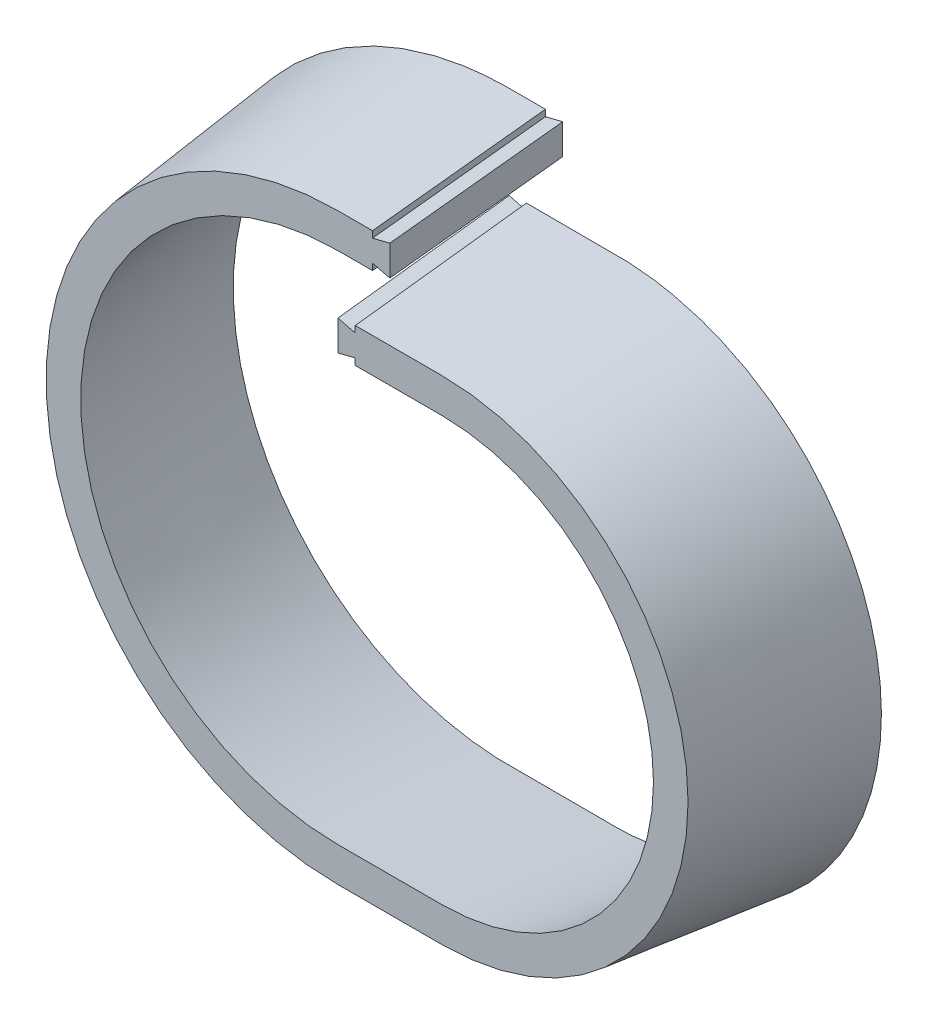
ISO-10303-21;
HEADER;
FILE_DESCRIPTION(('STEP AP214'),'2;1');
FILE_NAME('part.step','',(''),(''),'','','');
FILE_SCHEMA(('AUTOMOTIVE_DESIGN { 1 0 10303 214 1 1 1 1 }'));
ENDSEC;
DATA;
#1=APPLICATION_CONTEXT('core data for automotive mechanical design processes');
#2=APPLICATION_PROTOCOL_DEFINITION('international standard','automotive_design',2000,#1);
#3=PRODUCT_CONTEXT('',#1,'mechanical');
#4=PRODUCT('Part','Part','',(#3));
#5=PRODUCT_RELATED_PRODUCT_CATEGORY('part','',(#4));
#6=PRODUCT_DEFINITION_FORMATION('','',#4);
#7=PRODUCT_DEFINITION_CONTEXT('part definition',#1,'design');
#8=PRODUCT_DEFINITION('design','',#6,#7);
#9=PRODUCT_DEFINITION_SHAPE('','',#8);
#10=(LENGTH_UNIT() NAMED_UNIT(*) SI_UNIT(.MILLI.,.METRE.));
#11=(NAMED_UNIT(*) PLANE_ANGLE_UNIT() SI_UNIT($,.RADIAN.));
#12=(NAMED_UNIT(*) SI_UNIT($,.STERADIAN.) SOLID_ANGLE_UNIT());
#13=UNCERTAINTY_MEASURE_WITH_UNIT(LENGTH_MEASURE(1.E-05),#10,'distance_accuracy_value','');
#14=(GEOMETRIC_REPRESENTATION_CONTEXT(3) GLOBAL_UNCERTAINTY_ASSIGNED_CONTEXT((#13)) GLOBAL_UNIT_ASSIGNED_CONTEXT((#10,
#11,#12)) REPRESENTATION_CONTEXT('',''));
#15=CARTESIAN_POINT('',(0.,0.,0.));
#16=DIRECTION('',(0.,0.,1.));
#17=DIRECTION('',(1.,0.,0.));
#18=AXIS2_PLACEMENT_3D('',#15,#16,#17);
#19=CARTESIAN_POINT('',(6.,0.,0.));
#20=DIRECTION('',(0.,0.,-1.));
#21=DIRECTION('',(-1.,0.,0.));
#22=AXIS2_PLACEMENT_3D('',#19,#20,#21);
#23=PLANE('',#22);
#24=DIRECTION('',(0.,-1.,0.));
#25=VECTOR('',#24,1.);
#26=CARTESIAN_POINT('',(-6.,28.5,0.));
#27=LINE('',#26,#25);
#28=CARTESIAN_POINT('',(-6.,28.25,0.));
#29=VERTEX_POINT('',#28);
#30=CARTESIAN_POINT('',(-6.,24.75,0.));
#31=VERTEX_POINT('',#30);
#32=EDGE_CURVE('E486',#29,#31,#27,.T.);
#33=ORIENTED_EDGE('',*,*,#32,.T.);
#34=DIRECTION('',(-0.970142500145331,-0.242535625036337,0.));
#35=VECTOR('',#34,1.);
#36=CARTESIAN_POINT('',(-4.,25.25,0.));
#37=LINE('',#36,#35);
#38=CARTESIAN_POINT('',(-4.,25.25,0.));
#39=VERTEX_POINT('',#38);
#40=EDGE_CURVE('E391',#39,#31,#37,.T.);
#41=ORIENTED_EDGE('',*,*,#40,.F.);
#42=DIRECTION('',(0.,1.,0.));
#43=VECTOR('',#42,1.);
#44=CARTESIAN_POINT('',(-4.,24.5,0.));
#45=LINE('',#44,#43);
#46=CARTESIAN_POINT('',(-4.,24.5,0.));
#47=VERTEX_POINT('',#46);
#48=EDGE_CURVE('E389',#47,#39,#45,.T.);
#49=ORIENTED_EDGE('',*,*,#48,.F.);
#50=DIRECTION('',(1.,0.,0.));
#51=VECTOR('',#50,1.);
#52=CARTESIAN_POINT('',(-6.,24.5,0.));
#53=LINE('',#52,#51);
#54=CARTESIAN_POINT('',(6.,24.5,0.));
#55=VERTEX_POINT('',#54);
#56=EDGE_CURVE('E517',#47,#55,#53,.T.);
#57=ORIENTED_EDGE('',*,*,#56,.T.);
#58=CARTESIAN_POINT('',(6.,0.,0.));
#59=DIRECTION('',(0.,0.,-1.));
#60=DIRECTION('',(-1.,0.,0.));
#61=AXIS2_PLACEMENT_3D('',#58,#59,#60);
#62=CIRCLE('',#61,24.5);
#63=CARTESIAN_POINT('',(6.00000000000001,-24.5,0.));
#64=VERTEX_POINT('',#63);
#65=EDGE_CURVE('E519',#55,#64,#62,.T.);
#66=ORIENTED_EDGE('',*,*,#65,.T.);
#67=DIRECTION('',(-1.,0.,0.));
#68=VECTOR('',#67,1.);
#69=CARTESIAN_POINT('',(6.,-24.5,0.));
#70=LINE('',#69,#68);
#71=CARTESIAN_POINT('',(-5.99999999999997,-24.5,0.));
#72=VERTEX_POINT('',#71);
#73=EDGE_CURVE('E707',#64,#72,#70,.T.);
#74=ORIENTED_EDGE('',*,*,#73,.T.);
#75=CARTESIAN_POINT('',(-6.,5.25,0.));
#76=DIRECTION('',(0.,0.,-1.));
#77=DIRECTION('',(-1.,0.,0.));
#78=AXIS2_PLACEMENT_3D('',#75,#76,#77);
#79=CIRCLE('',#78,29.75);
#80=CARTESIAN_POINT('',(-6.00000000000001,35.,0.));
#81=VERTEX_POINT('',#80);
#82=EDGE_CURVE('E695',#72,#81,#79,.T.);
#83=ORIENTED_EDGE('',*,*,#82,.T.);
#84=DIRECTION('',(-1.,0.,0.));
#85=VECTOR('',#84,1.);
#86=CARTESIAN_POINT('',(0.,35.,0.));
#87=LINE('',#86,#85);
#88=CARTESIAN_POINT('',(-2.,35.,0.));
#89=VERTEX_POINT('',#88);
#90=EDGE_CURVE('E693',#89,#81,#87,.T.);
#91=ORIENTED_EDGE('',*,*,#90,.F.);
#92=DIRECTION('',(0.,-1.,0.));
#93=VECTOR('',#92,1.);
#94=CARTESIAN_POINT('',(-2.,0.,0.));
#95=LINE('',#94,#93);
#96=CARTESIAN_POINT('',(-2.,35.75,0.));
#97=VERTEX_POINT('',#96);
#98=EDGE_CURVE('E417',#97,#89,#95,.T.);
#99=ORIENTED_EDGE('',*,*,#98,.F.);
#100=DIRECTION('',(-0.970142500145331,0.242535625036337,0.));
#101=VECTOR('',#100,1.);
#102=CARTESIAN_POINT('',(8.29411764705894,33.1764705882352,0.));
#103=LINE('',#102,#101);
#104=CARTESIAN_POINT('',(0.,35.25,0.));
#105=VERTEX_POINT('',#104);
#106=EDGE_CURVE('E682',#105,#97,#103,.T.);
#107=ORIENTED_EDGE('',*,*,#106,.F.);
#108=DIRECTION('',(0.,-1.,0.));
#109=VECTOR('',#108,1.);
#110=CARTESIAN_POINT('',(0.,39.,0.));
#111=LINE('',#110,#109);
#112=CARTESIAN_POINT('',(0.,38.75,0.));
#113=VERTEX_POINT('',#112);
#114=EDGE_CURVE('E614',#113,#105,#111,.T.);
#115=ORIENTED_EDGE('',*,*,#114,.F.);
#116=DIRECTION('',(-0.970142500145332,-0.242535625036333,0.));
#117=VECTOR('',#116,1.);
#118=CARTESIAN_POINT('',(0.,38.75,0.));
#119=LINE('',#118,#117);
#120=CARTESIAN_POINT('',(-2.,38.25,0.));
#121=VERTEX_POINT('',#120);
#122=EDGE_CURVE('E420',#113,#121,#119,.T.);
#123=ORIENTED_EDGE('',*,*,#122,.T.);
#124=DIRECTION('',(0.,-1.,0.));
#125=VECTOR('',#124,1.);
#126=CARTESIAN_POINT('',(-2.,39.,0.));
#127=LINE('',#126,#125);
#128=CARTESIAN_POINT('',(-2.,39.,0.));
#129=VERTEX_POINT('',#128);
#130=EDGE_CURVE('E434',#129,#121,#127,.T.);
#131=ORIENTED_EDGE('',*,*,#130,.F.);
#132=DIRECTION('',(1.,0.,0.));
#133=VECTOR('',#132,1.);
#134=CARTESIAN_POINT('',(-6.,39.,0.));
#135=LINE('',#134,#133);
#136=CARTESIAN_POINT('',(-6.,39.,0.));
#137=VERTEX_POINT('',#136);
#138=EDGE_CURVE('E632',#137,#129,#135,.T.);
#139=ORIENTED_EDGE('',*,*,#138,.F.);
#140=CARTESIAN_POINT('',(-6.,5.25,0.));
#141=DIRECTION('',(0.,0.,-1.));
#142=DIRECTION('',(-1.,0.,0.));
#143=AXIS2_PLACEMENT_3D('',#140,#141,#142);
#144=CIRCLE('',#143,33.75);
#145=CARTESIAN_POINT('',(-6.,-28.5,0.));
#146=VERTEX_POINT('',#145);
#147=EDGE_CURVE('E635',#146,#137,#144,.T.);
#148=ORIENTED_EDGE('',*,*,#147,.F.);
#149=DIRECTION('',(1.,0.,0.));
#150=VECTOR('',#149,1.);
#151=CARTESIAN_POINT('',(-6.,-28.5,0.));
#152=LINE('',#151,#150);
#153=CARTESIAN_POINT('',(6.,-28.5,0.));
#154=VERTEX_POINT('',#153);
#155=EDGE_CURVE('E767',#146,#154,#152,.T.);
#156=ORIENTED_EDGE('',*,*,#155,.T.);
#157=CARTESIAN_POINT('',(6.,0.,0.));
#158=DIRECTION('',(0.,0.,-1.));
#159=DIRECTION('',(-1.,0.,0.));
#160=AXIS2_PLACEMENT_3D('',#157,#158,#159);
#161=CIRCLE('',#160,28.5);
#162=CARTESIAN_POINT('',(6.,28.5,0.));
#163=VERTEX_POINT('',#162);
#164=EDGE_CURVE('E496',#163,#154,#161,.T.);
#165=ORIENTED_EDGE('',*,*,#164,.F.);
#166=DIRECTION('',(1.,0.,0.));
#167=VECTOR('',#166,1.);
#168=CARTESIAN_POINT('',(-6.,28.5,0.));
#169=LINE('',#168,#167);
#170=CARTESIAN_POINT('',(-3.99999999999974,28.5,0.));
#171=VERTEX_POINT('',#170);
#172=EDGE_CURVE('E493',#171,#163,#169,.T.);
#173=ORIENTED_EDGE('',*,*,#172,.F.);
#174=DIRECTION('',(0.,1.,0.));
#175=VECTOR('',#174,1.);
#176=CARTESIAN_POINT('',(-4.,28.5,0.));
#177=LINE('',#176,#175);
#178=CARTESIAN_POINT('',(-4.00000000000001,27.75,0.));
#179=VERTEX_POINT('',#178);
#180=EDGE_CURVE('E284',#179,#171,#177,.T.);
#181=ORIENTED_EDGE('',*,*,#180,.F.);
#182=DIRECTION('',(0.970142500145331,-0.242535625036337,0.));
#183=VECTOR('',#182,1.);
#184=CARTESIAN_POINT('',(-4.00000000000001,27.75,0.));
#185=LINE('',#184,#183);
#186=EDGE_CURVE('E490',#29,#179,#185,.T.);
#187=ORIENTED_EDGE('',*,*,#186,.F.);
#188=EDGE_LOOP('',(#33,#41,#49,#57,#66,#74,#83,#91,#99,#107,#115,#123,#131,#139,#148,#156,#165,
#173,#181,#187));
#189=FACE_BOUND('',#188,.T.);
#190=ADVANCED_FACE('F259',(#189),#23,.F.);
#191=CARTESIAN_POINT('',(0.,57.,-203.2));
#192=DIRECTION('',(1.,0.,0.));
#193=DIRECTION('',(0.,1.,0.));
#194=AXIS2_PLACEMENT_3D('',#191,#192,#193);
#195=PLANE('',#194);
#196=DIRECTION('',(0.,-1.,0.));
#197=VECTOR('',#196,1.);
#198=CARTESIAN_POINT('',(0.,57.,-20.));
#199=LINE('',#198,#197);
#200=CARTESIAN_POINT('',(0.,40.9153543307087,-20.));
#201=VERTEX_POINT('',#200);
#202=CARTESIAN_POINT('',(0.,37.4153543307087,-20.));
#203=VERTEX_POINT('',#202);
#204=EDGE_CURVE('E394',#201,#203,#199,.T.);
#205=ORIENTED_EDGE('',*,*,#204,.F.);
#206=DIRECTION('',(0.,-0.107638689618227,0.994190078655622));
#207=VECTOR('',#206,1.);
#208=CARTESIAN_POINT('',(0.,60.6221817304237,-202.019423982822));
#209=LINE('',#208,#207);
#210=EDGE_CURVE('E497',#201,#113,#209,.T.);
#211=ORIENTED_EDGE('',*,*,#210,.T.);
#212=ORIENTED_EDGE('',*,*,#114,.T.);
#213=DIRECTION('',(0.,-0.107638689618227,0.994190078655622));
#214=VECTOR('',#213,1.);
#215=CARTESIAN_POINT('',(0.,57.1221817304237,-202.019423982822));
#216=LINE('',#215,#214);
#217=EDGE_CURVE('E407',#203,#105,#216,.T.);
#218=ORIENTED_EDGE('',*,*,#217,.F.);
#219=EDGE_LOOP('',(#205,#211,#212,#218));
#220=FACE_BOUND('',#219,.T.);
#221=ADVANCED_FACE('F459',(#220),#195,.T.);
#222=CARTESIAN_POINT('',(-8.00000106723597,50.5,-203.2));
#223=DIRECTION('',(-0.999951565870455,0.,0.00984204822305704));
#224=DIRECTION('',(0.,-1.,0.));
#225=AXIS2_PLACEMENT_3D('',#222,#223,#224);
#226=PLANE('',#225);
#227=DIRECTION('',(0.,1.,0.));
#228=VECTOR('',#227,1.);
#229=CARTESIAN_POINT('',(-6.1968504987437,50.5,-20.));
#230=LINE('',#229,#228);
#231=CARTESIAN_POINT('',(-6.1968504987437,26.9153543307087,-20.));
#232=VERTEX_POINT('',#231);
#233=CARTESIAN_POINT('',(-6.1968504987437,30.4153543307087,-20.));
#234=VERTEX_POINT('',#233);
#235=EDGE_CURVE('E672',#232,#234,#230,.T.);
#236=ORIENTED_EDGE('',*,*,#235,.F.);
#237=DIRECTION('',(0.00978487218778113,-0.107633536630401,0.994142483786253));
#238=VECTOR('',#237,1.);
#239=CARTESIAN_POINT('',(-8.01751286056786,46.9426296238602,-204.979197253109));
#240=LINE('',#239,#238);
#241=EDGE_CURVE('E385',#232,#31,#240,.T.);
#242=ORIENTED_EDGE('',*,*,#241,.T.);
#243=ORIENTED_EDGE('',*,*,#32,.F.);
#244=DIRECTION('',(0.00978487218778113,-0.107633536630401,0.994142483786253));
#245=VECTOR('',#244,1.);
#246=CARTESIAN_POINT('',(-8.01751286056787,50.4426296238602,-204.979197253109));
#247=LINE('',#246,#245);
#248=EDGE_CURVE('E405',#234,#29,#247,.T.);
#249=ORIENTED_EDGE('',*,*,#248,.F.);
#250=EDGE_LOOP('',(#236,#242,#243,#249));
#251=FACE_BOUND('',#250,.T.);
#252=ADVANCED_FACE('F454',(#251),#226,.T.);
#253=CARTESIAN_POINT('',(-8.00000106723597,46.5,-203.2));
#254=CARTESIAN_POINT('',(-6.,24.5,0.));
#255=CARTESIAN_POINT('',(-6.66666755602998,46.5,-203.2));
#256=CARTESIAN_POINT('',(-5.,24.5,0.));
#257=CARTESIAN_POINT('',(-4.09560659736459,46.4999999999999,-203.2));
#258=CARTESIAN_POINT('',(-2.91565736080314,24.5,0.));
#259=CARTESIAN_POINT('',(-0.308110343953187,46.5000000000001,-203.2));
#260=CARTESIAN_POINT('',(0.2799595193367,24.5,0.));
#261=CARTESIAN_POINT('',(3.59836396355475,46.4999999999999,-203.2));
#262=CARTESIAN_POINT('',(3.31323914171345,24.5,0.));
#263=CARTESIAN_POINT('',(6.4320983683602,46.5,-203.2));
#264=CARTESIAN_POINT('',(5.13936776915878,24.5,0.));
#265=CARTESIAN_POINT('',(10.9847766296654,46.5,-203.2));
#266=CARTESIAN_POINT('',(7.63836317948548,24.5,0.));
#267=CARTESIAN_POINT('',(16.9757689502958,45.9234606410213,-203.2));
#268=CARTESIAN_POINT('',(10.9004979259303,24.1695182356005,0.));
#269=CARTESIAN_POINT('',(25.6825618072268,43.3263877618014,-203.2));
#270=CARTESIAN_POINT('',(15.5683285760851,22.7301776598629,0.));
#271=CARTESIAN_POINT('',(33.7653430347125,39.0676201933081,-203.2));
#272=CARTESIAN_POINT('',(19.8317042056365,20.4110016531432,0.));
#273=CARTESIAN_POINT('',(40.8969234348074,33.2890342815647,-203.199999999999));
#274=CARTESIAN_POINT('',(23.5476547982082,17.3250764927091,0.));
#275=CARTESIAN_POINT('',(46.7825720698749,26.2004929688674,-203.200000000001));
#276=CARTESIAN_POINT('',(26.573210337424,13.5854884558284,0.));
#277=CARTESIAN_POINT('',(51.175262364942,18.0716728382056,-203.2));
#278=CARTESIAN_POINT('',(28.8173225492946,9.34579022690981,0.));
#279=CARTESIAN_POINT('',(53.8884256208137,9.22076052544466,-203.2));
#280=CARTESIAN_POINT('',(30.1889431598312,4.75953449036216,0.));
#281=CARTESIAN_POINT('',(54.8059554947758,0.,-203.199999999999));
#282=CARTESIAN_POINT('',(30.6566305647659,0.,0.));
#283=CARTESIAN_POINT('',(53.8884256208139,-9.22076052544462,-203.200000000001));
#284=CARTESIAN_POINT('',(30.1889431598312,-4.7595344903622,0.));
#285=CARTESIAN_POINT('',(51.175262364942,-18.0716728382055,-203.2));
#286=CARTESIAN_POINT('',(28.8173225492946,-9.34579022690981,0.));
#287=CARTESIAN_POINT('',(46.782572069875,-26.2004929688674,-203.2));
#288=CARTESIAN_POINT('',(26.573210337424,-13.5854884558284,0.));
#289=CARTESIAN_POINT('',(40.8969234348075,-33.2890342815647,-203.2));
#290=CARTESIAN_POINT('',(23.5476547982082,-17.3250764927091,0.));
#291=CARTESIAN_POINT('',(33.7653430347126,-39.067620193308,-203.2));
#292=CARTESIAN_POINT('',(19.8317042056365,-20.4110016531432,0.));
#293=CARTESIAN_POINT('',(25.6825618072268,-43.3263877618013,-203.2));
#294=CARTESIAN_POINT('',(15.5683285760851,-22.7301776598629,0.));
#295=CARTESIAN_POINT('',(16.9757689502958,-45.9234606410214,-203.2));
#296=CARTESIAN_POINT('',(10.9004979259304,-24.1695182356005,0.));
#297=CARTESIAN_POINT('',(10.9847766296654,-46.5,-203.2));
#298=CARTESIAN_POINT('',(7.63836317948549,-24.5,0.));
#299=CARTESIAN_POINT('',(6.43209836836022,-46.5,-203.2));
#300=CARTESIAN_POINT('',(5.13936776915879,-24.5,0.));
#301=CARTESIAN_POINT('',(3.70047745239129,-46.5,-203.2));
#302=CARTESIAN_POINT('',(3.27363376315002,-24.5,0.));
#303=CARTESIAN_POINT('',(-0.062114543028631,-46.4999999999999,-203.2));
#304=CARTESIAN_POINT('',(0.0778771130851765,-24.5,0.));
#305=CARTESIAN_POINT('',(-3.80166412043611,-46.5000000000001,-203.2));
#306=CARTESIAN_POINT('',(-3.17196305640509,-24.5,0.));
#307=CARTESIAN_POINT('',(-6.48723687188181,-46.5,-203.2));
#308=CARTESIAN_POINT('',(-5.10660758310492,-24.5,0.));
#309=CARTESIAN_POINT('',(-11.3421729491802,-46.5,-203.2));
#310=CARTESIAN_POINT('',(-7.97378482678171,-24.5,0.));
#311=CARTESIAN_POINT('',(-18.04045211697,-45.8505147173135,-203.2));
#312=CARTESIAN_POINT('',(-11.9124878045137,-24.1060458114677,0.));
#313=CARTESIAN_POINT('',(-27.7462313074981,-42.941156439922,-203.199999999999));
#314=CARTESIAN_POINT('',(-17.5665115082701,-22.3699577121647,0.));
#315=CARTESIAN_POINT('',(-36.7326404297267,-38.1890351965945,-203.200000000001));
#316=CARTESIAN_POINT('',(-22.752587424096,-19.5678947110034,0.));
#317=CARTESIAN_POINT('',(-44.6450967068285,-31.7611817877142,-203.2));
#318=CARTESIAN_POINT('',(-27.2775052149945,-15.8161935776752,0.));
#319=CARTESIAN_POINT('',(-51.1671479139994,-23.895068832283,-203.2));
#320=CARTESIAN_POINT('',(-30.9748104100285,-11.2644624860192,0.));
#321=CARTESIAN_POINT('',(-56.0350974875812,-14.8890297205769,-203.2));
#322=CARTESIAN_POINT('',(-33.7100565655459,-6.08956755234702,0.));
#323=CARTESIAN_POINT('',(-59.0499918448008,-5.09066719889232,-203.200000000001));
#324=CARTESIAN_POINT('',(-35.3848306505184,-0.489257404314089,0.));
#325=CARTESIAN_POINT('',(-60.0870406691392,5.11778464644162,-203.199999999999));
#326=CARTESIAN_POINT('',(-35.9397361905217,5.32458911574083,0.));
#327=CARTESIAN_POINT('',(-59.1015582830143,15.3356152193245,-203.200000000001));
#328=CARTESIAN_POINT('',(-35.3560249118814,11.1333259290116,0.));
#329=CARTESIAN_POINT('',(-56.1313019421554,25.1609050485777,-203.2));
#330=CARTESIAN_POINT('',(-33.6561328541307,16.7189123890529,0.));
#331=CARTESIAN_POINT('',(-51.2949019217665,34.2079212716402,-203.2));
#332=CARTESIAN_POINT('',(-30.9028036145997,21.8712420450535,0.));
#333=CARTESIAN_POINT('',(-44.786611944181,42.1236143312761,-203.2));
#334=CARTESIAN_POINT('',(-27.1971246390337,26.3953782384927,0.));
#335=CARTESIAN_POINT('',(-36.8674469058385,48.6028195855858,-203.2));
#336=CARTESIAN_POINT('',(-22.6752706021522,30.1180918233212,0.));
#337=CARTESIAN_POINT('',(-27.8535479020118,53.4005128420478,-203.2));
#338=CARTESIAN_POINT('',(-17.5042367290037,32.8939704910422,0.));
#339=CARTESIAN_POINT('',(-18.1017059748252,56.3422119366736,-203.2));
#340=CARTESIAN_POINT('',(-11.8764266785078,34.6110729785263,0.));
#341=CARTESIAN_POINT('',(-11.3634007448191,57.,-203.2));
#342=CARTESIAN_POINT('',(-7.96117246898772,35.,0.));
#343=CARTESIAN_POINT('',(-7.23881481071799,57.,-203.2));
#344=CARTESIAN_POINT('',(-5.55615815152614,35.,0.));
#345=CARTESIAN_POINT('',(-5.83316348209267,56.9999999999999,-203.2));
#346=CARTESIAN_POINT('',(-4.62349907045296,35.,0.));
#347=CARTESIAN_POINT('',(-3.87114162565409,57.0000000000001,-203.2));
#348=CARTESIAN_POINT('',(-3.10788595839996,35.,0.));
#349=CARTESIAN_POINT('',(-1.95999361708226,56.9999999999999,-203.2));
#350=CARTESIAN_POINT('',(-1.53264401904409,35.,0.));
#351=CARTESIAN_POINT('',(-0.666666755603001,57.,-203.2));
#352=CARTESIAN_POINT('',(-0.500000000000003,35.,0.));
#353=CARTESIAN_POINT('',(0.,57.,-203.2));
#354=CARTESIAN_POINT('',(0.,35.,0.));
#355=B_SPLINE_SURFACE_WITH_KNOTS('',3,1,((#253,#254),(#255,#256),(#257,#258),(#259,#260),(#261,
#262),(#263,#264),(#265,#266),(#267,#268),(#269,#270),(#271,#272),(#273,#274),(#275,#276),(#277,
#278),(#279,#280),(#281,#282),(#283,#284),(#285,#286),(#287,#288),(#289,#290),(#291,#292),(#293,
#294),(#295,#296),(#297,#298),(#299,#300),(#301,#302),(#303,#304),(#305,#306),(#307,#308),(#309,
#310),(#311,#312),(#313,#314),(#315,#316),(#317,#318),(#319,#320),(#321,#322),(#323,#324),(#325,
#326),(#327,#328),(#329,#330),(#331,#332),(#333,#334),(#335,#336),(#337,#338),(#339,#340),(#341,
#342),(#343,#344),(#345,#346),(#347,#348),(#349,#350),(#351,#352),(#353,#354)),.UNSPECIFIED.,
.F.,.F.,.F.,(4,1,1,1,2,1,1,1,1,1,1,1,1,1,1,1,1,1,1,1,2,1,1,1,2,1,1,1,1,1,1,1,1,1,1,1,1,1,1,1,2,
1,1,1,4),(2,2),(0.,0.0131912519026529,0.0263825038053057,0.0395737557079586,0.0527650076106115,
0.077876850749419,0.102988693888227,0.128100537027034,0.153212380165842,0.178324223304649,
0.203436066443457,0.228547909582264,0.253659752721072,0.278771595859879,0.303883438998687,
0.328995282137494,0.354107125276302,0.379218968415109,0.404330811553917,0.429442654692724,
0.454554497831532,0.467745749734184,0.480937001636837,0.49412825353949,0.507319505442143,
0.536463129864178,0.565606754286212,0.594750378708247,0.623894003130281,0.653037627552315,
0.68218125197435,0.711324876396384,0.740468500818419,0.769612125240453,0.798755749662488,
0.827899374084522,0.857042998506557,0.886186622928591,0.915330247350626,0.94447387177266,
0.973617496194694,0.980213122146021,0.986808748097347,0.993404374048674,1.),(0.,1.),.UNSPECIFIED.);
#356=CARTESIAN_POINT('',(0.,37.1653543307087,-20.));
#357=CARTESIAN_POINT('',(-0.4624324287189,37.1653543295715,-20.));
#358=CARTESIAN_POINT('',(-0.924864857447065,37.1653543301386,-20.));
#359=CARTESIAN_POINT('',(-1.85222509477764,37.1653543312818,-20.));
#360=CARTESIAN_POINT('',(-2.31715290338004,37.1653543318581,-20.));
#361=CARTESIAN_POINT('',(-3.01537892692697,37.1653543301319,-20.));
#362=CARTESIAN_POINT('',(-3.24867714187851,37.1653543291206,-20.));
#363=CARTESIAN_POINT('',(-3.71527127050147,37.1653543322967,-20.));
#364=CARTESIAN_POINT('',(-3.94856718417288,37.1653543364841,-20.));
#365=CARTESIAN_POINT('',(-4.29871883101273,37.1653543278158,-20.));
#366=CARTESIAN_POINT('',(-4.41557456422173,37.1653543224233,-20.));
#367=CARTESIAN_POINT('',(-4.64928602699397,37.165354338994,-20.));
#368=CARTESIAN_POINT('',(-4.76614175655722,37.165354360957,-20.));
#369=CARTESIAN_POINT('',(-4.99985744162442,37.1653543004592,-20.));
#370=CARTESIAN_POINT('',(-5.11671739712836,37.1653542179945,-20.));
#371=CARTESIAN_POINT('',(-5.35043732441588,37.1653544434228,-20.));
#372=CARTESIAN_POINT('',(-5.46729729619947,37.165354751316,-20.));
#373=CARTESIAN_POINT('',(-5.64259198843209,37.165354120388,-20.));
#374=CARTESIAN_POINT('',(-5.70102671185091,37.1653537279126,-20.));
#375=CARTESIAN_POINT('',(-5.81789620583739,37.1653549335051,-20.));
#376=CARTESIAN_POINT('',(-5.87633097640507,37.1653565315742,-20.));
#377=CARTESIAN_POINT('',(-5.99320051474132,37.1653521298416,-20.));
#378=CARTESIAN_POINT('',(-6.05163528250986,37.1653461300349,-20.));
#379=CARTESIAN_POINT('',(-6.16850487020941,37.1653625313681,-20.));
#380=CARTESIAN_POINT('',(-6.22693969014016,37.1653849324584,-20.));
#381=CARTESIAN_POINT('',(-6.34380477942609,37.1650775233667,-20.));
#382=CARTESIAN_POINT('',(-6.40223504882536,37.1647477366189,-20.));
#383=CARTESIAN_POINT('',(-6.51909285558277,37.1637745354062,-20.));
#384=CARTESIAN_POINT('',(-6.57752039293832,37.1631311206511,-20.));
#385=CARTESIAN_POINT('',(-6.75279556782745,37.1607165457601,-20.));
#386=CARTESIAN_POINT('',(-6.8696369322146,37.1584610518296,-20.));
#387=CARTESIAN_POINT('',(-7.10400028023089,37.1526495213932,-20.));
#388=CARTESIAN_POINT('',(-7.22152206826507,37.1490856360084,-20.));
#389=CARTESIAN_POINT('',(-7.4565196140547,37.1406586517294,-20.));
#390=CARTESIAN_POINT('',(-7.57399537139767,37.1357955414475,-20.));
#391=CARTESIAN_POINT('',(-7.92635008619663,37.1192592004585,-20.));
#392=CARTESIAN_POINT('',(-8.16114075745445,37.1056393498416,-20.));
#393=CARTESIAN_POINT('',(-8.62981030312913,37.073257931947,-20.));
#394=CARTESIAN_POINT('',(-8.86369002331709,37.0545085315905,-20.));
#395=CARTESIAN_POINT('',(-9.33097190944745,37.0118659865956,-20.));
#396=CARTESIAN_POINT('',(-9.56437409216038,36.9879730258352,-20.));
#397=CARTESIAN_POINT('',(-10.0302306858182,36.9350951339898,-20.));
#398=CARTESIAN_POINT('',(-10.2626860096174,36.90611826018,-20.));
#399=CARTESIAN_POINT('',(-10.7269017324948,36.8430590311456,-20.));
#400=CARTESIAN_POINT('',(-10.9586621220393,36.8089766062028,-20.));
#401=CARTESIAN_POINT('',(-11.6523340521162,36.699147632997,-20.));
#402=CARTESIAN_POINT('',(-12.1130639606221,36.615770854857,-20.));
#403=CARTESIAN_POINT('',(-13.0303163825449,36.4287871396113,-20.));
#404=CARTESIAN_POINT('',(-13.4868393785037,36.3251825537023,-20.));
#405=CARTESIAN_POINT('',(-14.5215582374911,36.0663108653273,-20.));
#406=CARTESIAN_POINT('',(-15.0981783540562,35.9046939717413,-20.));
#407=CARTESIAN_POINT('',(-16.2421122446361,35.5491399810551,-20.));
#408=CARTESIAN_POINT('',(-16.8094139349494,35.3551640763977,-20.));
#409=CARTESIAN_POINT('',(-17.9323725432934,34.935489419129,-20.));
#410=CARTESIAN_POINT('',(-18.4880257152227,34.7097806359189,-20.));
#411=CARTESIAN_POINT('',(-19.5839926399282,34.2281206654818,-20.));
#412=CARTESIAN_POINT('',(-20.1243488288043,33.9722659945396,-20.));
#413=CARTESIAN_POINT('',(-21.189621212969,33.4308002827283,-20.));
#414=CARTESIAN_POINT('',(-21.7145447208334,33.1452036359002,-20.));
#415=CARTESIAN_POINT('',(-22.7474674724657,32.5450994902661,-20.));
#416=CARTESIAN_POINT('',(-23.2554690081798,32.2305959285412,-20.));
#417=CARTESIAN_POINT('',(-24.5030509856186,31.4087492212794,-20.));
#418=CARTESIAN_POINT('',(-25.2310937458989,30.8837561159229,-20.));
#419=CARTESIAN_POINT('',(-26.6406038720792,29.7743153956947,-20.));
#420=CARTESIAN_POINT('',(-27.322063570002,29.189858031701,-20.));
#421=CARTESIAN_POINT('',(-28.3058237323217,28.2714440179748,-20.));
#422=CARTESIAN_POINT('',(-28.627567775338,27.9580984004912,-20.));
#423=CARTESIAN_POINT('',(-29.257505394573,27.3180852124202,-20.));
#424=CARTESIAN_POINT('',(-29.565698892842,26.9914175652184,-20.));
#425=CARTESIAN_POINT('',(-30.4691764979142,25.9923607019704,-20.));
#426=CARTESIAN_POINT('',(-31.043540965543,25.3007463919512,-20.));
#427=CARTESIAN_POINT('',(-31.8595470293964,24.2293752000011,-20.));
#428=CARTESIAN_POINT('',(-32.1239241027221,23.8666479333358,-20.));
#429=CARTESIAN_POINT('',(-32.6371269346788,23.1303408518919,-20.));
#430=CARTESIAN_POINT('',(-32.8859527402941,22.7567610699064,-20.));
#431=CARTESIAN_POINT('',(-33.6084043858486,21.6207754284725,-20.));
#432=CARTESIAN_POINT('',(-34.0581170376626,20.8429754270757,-20.));
#433=CARTESIAN_POINT('',(-34.8903000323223,19.2527934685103,-20.));
#434=CARTESIAN_POINT('',(-35.272802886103,18.4404284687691,-20.));
#435=CARTESIAN_POINT('',(-35.9678502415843,16.7863060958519,-20.));
#436=CARTESIAN_POINT('',(-36.2803950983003,15.9445488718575,-20.));
#437=CARTESIAN_POINT('',(-36.8335808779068,14.2377818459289,-20.));
#438=CARTESIAN_POINT('',(-37.0742338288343,13.3727759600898,-20.));
#439=CARTESIAN_POINT('',(-37.3798903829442,12.062580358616,-20.));
#440=CARTESIAN_POINT('',(-37.4725626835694,11.6236842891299,-20.));
#441=CARTESIAN_POINT('',(-37.6392822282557,10.7423799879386,-20.));
#442=CARTESIAN_POINT('',(-37.7133294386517,10.2999717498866,-20.));
#443=CARTESIAN_POINT('',(-37.9074316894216,8.96849842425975,-20.));
#444=CARTESIAN_POINT('',(-37.9994626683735,8.0751189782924,-20.));
#445=CARTESIAN_POINT('',(-38.0808976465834,6.73197154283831,-20.));
#446=CARTESIAN_POINT('',(-38.0986062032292,6.28369233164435,-20.));
#447=CARTESIAN_POINT('',(-38.1150758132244,5.38677512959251,-20.));
#448=CARTESIAN_POINT('',(-38.1138369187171,4.93813713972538,-20.));
#449=CARTESIAN_POINT('',(-38.0817088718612,3.59284569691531,-20.));
#450=CARTESIAN_POINT('',(-38.0224144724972,2.69671366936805,-20.));
#451=CARTESIAN_POINT('',(-37.8287177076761,0.912706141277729,-20.));
#452=CARTESIAN_POINT('',(-37.6943152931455,0.0248306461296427,-20.));
#453=CARTESIAN_POINT('',(-37.3510232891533,-1.73636819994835,-20.));
#454=CARTESIAN_POINT('',(-37.1421364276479,-2.60969208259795,-20.));
#455=CARTESIAN_POINT('',(-36.6516491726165,-4.3357807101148,-20.));
#456=CARTESIAN_POINT('',(-36.3700489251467,-5.18854549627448,-20.));
#457=CARTESIAN_POINT('',(-35.8945098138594,-6.44762378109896,-20.));
#458=CARTESIAN_POINT('',(-35.7270723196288,-6.86411415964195,-20.));
#459=CARTESIAN_POINT('',(-35.3747487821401,-7.6896361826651,-20.));
#460=CARTESIAN_POINT('',(-35.1898626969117,-8.09866780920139,-20.));
#461=CARTESIAN_POINT('',(-34.6095687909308,-9.31355481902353,-20.));
#462=CARTESIAN_POINT('',(-34.1884565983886,-10.1073841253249,-20.));
#463=CARTESIAN_POINT('',(-33.5080075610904,-11.2690994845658,-20.));
#464=CARTESIAN_POINT('',(-33.2730436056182,-11.6515246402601,-20.));
#465=CARTESIAN_POINT('',(-32.7871583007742,-12.4061129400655,-20.));
#466=CARTESIAN_POINT('',(-32.5362369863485,-12.7782761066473,-20.));
#467=CARTESIAN_POINT('',(-31.7602756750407,-13.8783203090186,-20.));
#468=CARTESIAN_POINT('',(-31.2119245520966,-14.5899501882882,-20.));
#469=CARTESIAN_POINT('',(-30.05783676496,-15.9639614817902,-20.));
#470=CARTESIAN_POINT('',(-29.4521452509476,-16.6263809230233,-20.));
#471=CARTESIAN_POINT('',(-28.1869605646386,-17.8977890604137,-20.));
#472=CARTESIAN_POINT('',(-27.5274627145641,-18.5067731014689,-20.));
#473=CARTESIAN_POINT('',(-26.158942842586,-19.667737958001,-20.));
#474=CARTESIAN_POINT('',(-25.4498782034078,-20.2196686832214,-20.));
#475=CARTESIAN_POINT('',(-24.3535458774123,-21.0010560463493,-20.));
#476=CARTESIAN_POINT('',(-23.9826477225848,-21.25376595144,-20.));
#477=CARTESIAN_POINT('',(-23.2305095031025,-21.7432815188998,-20.));
#478=CARTESIAN_POINT('',(-22.849270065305,-21.9800881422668,-20.));
#479=CARTESIAN_POINT('',(-21.9478326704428,-22.5140306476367,-20.));
#480=CARTESIAN_POINT('',(-21.4238564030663,-22.8048111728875,-20.));
#481=CARTESIAN_POINT('',(-20.3602983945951,-23.3565347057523,-20.));
#482=CARTESIAN_POINT('',(-19.8207133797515,-23.6174713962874,-20.));
#483=CARTESIAN_POINT('',(-18.7272678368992,-24.108705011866,-20.));
#484=CARTESIAN_POINT('',(-18.1733966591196,-24.3389782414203,-20.));
#485=CARTESIAN_POINT('',(-17.0556010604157,-24.7671330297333,-20.));
#486=CARTESIAN_POINT('',(-16.491720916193,-24.9651301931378,-20.));
#487=CARTESIAN_POINT('',(-15.3540384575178,-25.3291386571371,-20.));
#488=CARTESIAN_POINT('',(-14.7802410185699,-25.495165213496,-20.));
#489=CARTESIAN_POINT('',(-13.6252376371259,-25.7945289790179,-20.));
#490=CARTESIAN_POINT('',(-13.0440468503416,-25.9279243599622,-20.));
#491=CARTESIAN_POINT('',(-12.2008856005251,-26.0966619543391,-20.));
#492=CARTESIAN_POINT('',(-11.94149913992,-26.1452223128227,-20.));
#493=CARTESIAN_POINT('',(-11.421599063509,-26.235887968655,-20.));
#494=CARTESIAN_POINT('',(-11.1610854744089,-26.2779934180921,-20.));
#495=CARTESIAN_POINT('',(-10.6390359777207,-26.3557412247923,-20.));
#496=CARTESIAN_POINT('',(-10.3774998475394,-26.3913820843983,-20.));
#497=CARTESIAN_POINT('',(-9.85361381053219,-26.4561747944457,-20.));
#498=CARTESIAN_POINT('',(-9.59126386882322,-26.485326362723,-20.));
#499=CARTESIAN_POINT('',(-9.06562470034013,-26.5371518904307,-20.));
#500=CARTESIAN_POINT('',(-8.80233474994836,-26.5598185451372,-20.));
#501=CARTESIAN_POINT('',(-8.40705770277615,-26.5889143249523,-20.));
#502=CARTESIAN_POINT('',(-8.27524668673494,-26.5977953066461,-20.));
#503=CARTESIAN_POINT('',(-8.01152234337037,-26.613921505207,-20.));
#504=CARTESIAN_POINT('',(-7.87960901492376,-26.621166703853,-20.));
#505=CARTESIAN_POINT('',(-7.61544261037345,-26.6340318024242,-20.));
#506=CARTESIAN_POINT('',(-7.48318937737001,-26.6396484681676,-20.));
#507=CARTESIAN_POINT('',(-7.21862597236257,-26.6492355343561,-20.));
#508=CARTESIAN_POINT('',(-7.08631580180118,-26.6532059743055,-20.));
#509=CARTESIAN_POINT('',(-6.88781581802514,-26.6579252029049,-20.));
#510=CARTESIAN_POINT('',(-6.82164014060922,-26.6592922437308,-20.));
#511=CARTESIAN_POINT('',(-6.68928190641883,-26.6616147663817,-20.));
#512=CARTESIAN_POINT('',(-6.62309934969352,-26.6625702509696,-20.));
#513=CARTESIAN_POINT('',(-6.49072795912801,-26.6640655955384,-20.));
#514=CARTESIAN_POINT('',(-6.424539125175,-26.6646054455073,-20.));
#515=CARTESIAN_POINT('',(-6.3252541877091,-26.6651141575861,-20.));
#516=CARTESIAN_POINT('',(-6.29215881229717,-26.6652335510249,-20.));
#517=CARTESIAN_POINT('',(-6.22596781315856,-26.6653534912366,-20.));
#518=CARTESIAN_POINT('',(-6.1928721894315,-26.6653540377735,-20.));
#519=CARTESIAN_POINT('',(-6.09356362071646,-26.6653549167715,-20.));
#520=CARTESIAN_POINT('',(-6.02735071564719,-26.6653544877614,-20.));
#521=CARTESIAN_POINT('',(-5.89492507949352,-26.6653541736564,-20.));
#522=CARTESIAN_POINT('',(-5.82871234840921,-26.6653542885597,-20.));
#523=CARTESIAN_POINT('',(-5.69628751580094,-26.6653543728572,-20.));
#524=CARTESIAN_POINT('',(-5.6300754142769,-26.6653543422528,-20.));
#525=CARTESIAN_POINT('',(-5.49765115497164,-26.6653543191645,-20.));
#526=CARTESIAN_POINT('',(-5.43143899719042,-26.6653543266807,-20.));
#527=CARTESIAN_POINT('',(-5.23280706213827,-26.6653543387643,-20.));
#528=CARTESIAN_POINT('',(-5.10038728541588,-26.6653543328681,-20.));
#529=CARTESIAN_POINT('',(-4.83554735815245,-26.6653543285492,-20.));
#530=CARTESIAN_POINT('',(-4.7031272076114,-26.6653543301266,-20.));
#531=CARTESIAN_POINT('',(-4.43704473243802,-26.6653543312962,-20.));
#532=CARTESIAN_POINT('',(-4.30338240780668,-26.6653543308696,-20.));
#533=CARTESIAN_POINT('',(-4.03605785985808,-26.6653543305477,-20.));
#534=CARTESIAN_POINT('',(-3.90239563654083,-26.6653543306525,-20.));
#535=CARTESIAN_POINT('',(-3.50140615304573,-26.6653543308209,-20.));
#536=CARTESIAN_POINT('',(-3.23407889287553,-26.6653543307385,-20.));
#537=CARTESIAN_POINT('',(-2.69976291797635,-26.6653543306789,-20.));
#538=CARTESIAN_POINT('',(-2.43277420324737,-26.6653543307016,-20.));
#539=CARTESIAN_POINT('',(-1.89879750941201,-26.6653543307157,-20.));
#540=CARTESIAN_POINT('',(-1.63180953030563,-26.6653543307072,-20.));
#541=CARTESIAN_POINT('',(-1.09799397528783,-26.6653543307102,-20.));
#542=CARTESIAN_POINT('',(-0.831166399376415,-26.6653543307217,-20.));
#543=CARTESIAN_POINT('',(-0.297511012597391,-26.6653543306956,-20.));
#544=CARTESIAN_POINT('',(-0.0306832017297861,-26.6653543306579,-20.));
#545=CARTESIAN_POINT('',(0.76983249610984,-26.6653543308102,-20.));
#546=CARTESIAN_POINT('',(1.30352038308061,-26.6653543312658,-20.));
#547=CARTESIAN_POINT('',(2.10424507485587,-26.6653543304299,-20.));
#548=CARTESIAN_POINT('',(2.3712818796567,-26.6653543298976,-20.));
#549=CARTESIAN_POINT('',(2.90535607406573,-26.6653543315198,-20.));
#550=CARTESIAN_POINT('',(3.17239346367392,-26.6653543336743,-20.));
#551=CARTESIAN_POINT('',(3.62095677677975,-26.6653543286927,-20.));
#552=CARTESIAN_POINT('',(3.80248270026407,-26.6653543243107,-20.));
#553=CARTESIAN_POINT('',(4.16553326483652,-26.6653543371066,-20.));
#554=CARTESIAN_POINT('',(4.34705790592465,-26.6653543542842,-20.));
#555=CARTESIAN_POINT('',(4.71015148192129,-26.6653543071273,-20.));
#556=CARTESIAN_POINT('',(4.8917204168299,-26.6653542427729,-20.));
#557=CARTESIAN_POINT('',(5.16407619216,-26.6653543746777,-20.));
#558=CARTESIAN_POINT('',(5.25486303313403,-26.6653544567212,-20.));
#559=CARTESIAN_POINT('',(5.43643653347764,-26.6653542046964,-20.));
#560=CARTESIAN_POINT('',(5.52722319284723,-26.6653538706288,-20.));
#561=CARTESIAN_POINT('',(5.70876192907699,-26.6653547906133,-20.));
#562=CARTESIAN_POINT('',(5.79951400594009,-26.6653560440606,-20.));
#563=CARTESIAN_POINT('',(5.93564243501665,-26.6653534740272,-20.));
#564=CARTESIAN_POINT('',(5.98101877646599,-26.6653518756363,-20.));
#565=CARTESIAN_POINT('',(6.07177152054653,-26.6653567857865,-20.));
#566=CARTESIAN_POINT('',(6.11714792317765,-26.6653632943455,-20.));
#567=CARTESIAN_POINT('',(6.20789896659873,-26.6653453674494,-20.));
#568=CARTESIAN_POINT('',(6.2532736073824,-26.6653209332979,-20.));
#569=CARTESIAN_POINT('',(6.34402182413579,-26.6649970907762,-20.));
#570=CARTESIAN_POINT('',(6.38939540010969,-26.6646976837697,-20.));
#571=CARTESIAN_POINT('',(6.48013969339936,-26.6638775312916,-20.));
#572=CARTESIAN_POINT('',(6.52551041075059,-26.6633567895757,-20.));
#573=CARTESIAN_POINT('',(6.61624874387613,-26.6620798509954,-20.));
#574=CARTESIAN_POINT('',(6.66161635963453,-26.6613236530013,-20.));
#575=CARTESIAN_POINT('',(6.79762876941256,-26.6587089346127,-20.));
#576=CARTESIAN_POINT('',(6.88826714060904,-26.6565035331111,-20.));
#577=CARTESIAN_POINT('',(7.06951788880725,-26.6511654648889,-20.));
#578=CARTESIAN_POINT('',(7.16013026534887,-26.6480327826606,-20.));
#579=CARTESIAN_POINT('',(7.34132354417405,-26.6408417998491,-20.));
#580=CARTESIAN_POINT('',(7.43190444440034,-26.6367834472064,-20.));
#581=CARTESIAN_POINT('',(7.61301901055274,-26.6277422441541,-20.));
#582=CARTESIAN_POINT('',(7.70355267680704,-26.6227594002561,-20.));
#583=CARTESIAN_POINT('',(7.97506924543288,-26.6064258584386,-20.));
#584=CARTESIAN_POINT('',(8.15597123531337,-26.5936900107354,-20.));
#585=CARTESIAN_POINT('',(8.5174696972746,-26.5645352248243,-20.));
#586=CARTESIAN_POINT('',(8.6980661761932,-26.5481163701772,-20.));
#587=CARTESIAN_POINT('',(9.23452435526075,-26.4938313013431,-20.));
#588=CARTESIAN_POINT('',(9.58986346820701,-26.4506457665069,-20.));
#589=CARTESIAN_POINT('',(10.2989690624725,-26.3499791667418,-20.));
#590=CARTESIAN_POINT('',(10.6527329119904,-26.2924796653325,-20.));
#591=CARTESIAN_POINT('',(11.3579388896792,-26.1632353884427,-20.));
#592=CARTESIAN_POINT('',(11.7093789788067,-26.0914794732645,-20.));
#593=CARTESIAN_POINT('',(12.4091836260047,-25.9338458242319,-20.));
#594=CARTESIAN_POINT('',(12.7575472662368,-25.8479640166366,-20.));
#595=CARTESIAN_POINT('',(13.4504614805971,-25.6622617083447,-20.));
#596=CARTESIAN_POINT('',(13.7950128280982,-25.562444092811,-20.));
#597=CARTESIAN_POINT('',(14.4941840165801,-25.3445174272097,-20.));
#598=CARTESIAN_POINT('',(14.8486195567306,-25.225816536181,-20.));
#599=CARTESIAN_POINT('',(15.5519554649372,-24.9736676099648,-20.));
#600=CARTESIAN_POINT('',(15.9008591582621,-24.8402288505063,-20.));
#601=CARTESIAN_POINT('',(16.5925858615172,-24.5587399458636,-20.));
#602=CARTESIAN_POINT('',(16.9354108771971,-24.4106947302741,-20.));
#603=CARTESIAN_POINT('',(17.6144914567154,-24.1002773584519,-20.));
#604=CARTESIAN_POINT('',(17.9507473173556,-23.9379058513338,-20.));
#605=CARTESIAN_POINT('',(18.6189812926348,-23.5977483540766,-20.));
#606=CARTESIAN_POINT('',(18.9508985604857,-23.4198428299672,-20.));
#607=CARTESIAN_POINT('',(19.6069982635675,-23.05014183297,-20.));
#608=CARTESIAN_POINT('',(19.9311790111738,-22.8583433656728,-20.));
#609=CARTESIAN_POINT('',(20.5712097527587,-22.4612263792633,-20.));
#610=CARTESIAN_POINT('',(20.8870587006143,-22.2559061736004,-20.));
#611=CARTESIAN_POINT('',(21.5098234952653,-21.8321327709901,-20.));
#612=CARTESIAN_POINT('',(21.8167390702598,-21.6136791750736,-20.));
#613=CARTESIAN_POINT('',(22.5207797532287,-21.0898454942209,-20.));
#614=CARTESIAN_POINT('',(22.9142700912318,-20.7795594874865,-20.));
#615=CARTESIAN_POINT('',(23.6831368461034,-20.1373968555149,-20.));
#616=CARTESIAN_POINT('',(24.0585150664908,-19.8055223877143,-20.));
#617=CARTESIAN_POINT('',(24.7898555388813,-19.1210594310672,-20.));
#618=CARTESIAN_POINT('',(25.1458189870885,-18.7684722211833,-20.));
#619=CARTESIAN_POINT('',(25.8360005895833,-18.0448322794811,-20.));
#620=CARTESIAN_POINT('',(26.1702860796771,-17.6738437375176,-20.));
#621=CARTESIAN_POINT('',(26.8175257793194,-16.9136510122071,-20.));
#622=CARTESIAN_POINT('',(27.1304785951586,-16.5244456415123,-20.));
#623=CARTESIAN_POINT('',(27.7341078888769,-15.7291590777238,-20.));
#624=CARTESIAN_POINT('',(28.0247834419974,-15.3230771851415,-20.));
#625=CARTESIAN_POINT('',(28.7224324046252,-14.2884775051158,-20.));
#626=CARTESIAN_POINT('',(29.1150141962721,-13.6501271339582,-20.));
#627=CARTESIAN_POINT('',(29.6625821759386,-12.6698651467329,-20.));
#628=CARTESIAN_POINT('',(29.8382335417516,-12.3392934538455,-20.));
#629=CARTESIAN_POINT('',(30.1754810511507,-11.6710309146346,-20.));
#630=CARTESIAN_POINT('',(30.3370774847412,-11.333340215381,-20.));
#631=CARTESIAN_POINT('',(30.6460022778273,-10.6510591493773,-20.));
#632=CARTESIAN_POINT('',(30.7933151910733,-10.3064617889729,-20.));
#633=CARTESIAN_POINT('',(31.073142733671,-9.61133298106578,-20.));
#634=CARTESIAN_POINT('',(31.2056572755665,-9.2608014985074,-20.));
#635=CARTESIAN_POINT('',(31.580797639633,-8.2012693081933,-20.));
#636=CARTESIAN_POINT('',(31.8010757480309,-7.48420802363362,-20.));
#637=CARTESIAN_POINT('',(32.1806518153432,-6.03432303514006,-20.));
#638=CARTESIAN_POINT('',(32.3399568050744,-5.30150115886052,-20.));
#639=CARTESIAN_POINT('',(32.5965905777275,-3.82507567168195,-20.));
#640=CARTESIAN_POINT('',(32.6939208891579,-3.08147232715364,-20.));
#641=CARTESIAN_POINT('',(32.8257000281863,-1.58883275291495,-20.));
#642=CARTESIAN_POINT('',(32.8601597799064,-0.839797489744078,-20.));
#643=CARTESIAN_POINT('',(32.8652853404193,0.658490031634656,-20.));
#644=CARTESIAN_POINT('',(32.8359513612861,1.40774228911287,-20.));
#645=CARTESIAN_POINT('',(32.7143212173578,2.90137757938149,-20.));
#646=CARTESIAN_POINT('',(32.6220024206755,3.6457587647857,-20.));
#647=CARTESIAN_POINT('',(32.3752985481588,5.12415844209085,-20.));
#648=CARTESIAN_POINT('',(32.2209115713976,5.85817661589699,-20.));
#649=CARTESIAN_POINT('',(31.8511239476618,7.31058666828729,-20.));
#650=CARTESIAN_POINT('',(31.6357393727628,8.028982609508,-20.));
#651=CARTESIAN_POINT('',(31.2678871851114,9.09083840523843,-20.));
#652=CARTESIAN_POINT('',(31.1377939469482,9.44219724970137,-20.));
#653=CARTESIAN_POINT('',(30.8627844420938,10.1390903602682,-20.));
#654=CARTESIAN_POINT('',(30.7178682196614,10.4846246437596,-20.));
#655=CARTESIAN_POINT('',(30.4134525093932,11.1693760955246,-20.));
#656=CARTESIAN_POINT('',(30.2539470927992,11.5085906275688,-20.));
#657=CARTESIAN_POINT('',(29.9207885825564,12.1799738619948,-20.));
#658=CARTESIAN_POINT('',(29.7471353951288,12.5121425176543,-20.));
#659=CARTESIAN_POINT('',(29.2054436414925,13.4972772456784,-20.));
#660=CARTESIAN_POINT('',(28.8166243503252,14.138981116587,-20.));
#661=CARTESIAN_POINT('',(27.9861150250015,15.388190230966,-20.));
#662=CARTESIAN_POINT('',(27.5443611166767,15.9956528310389,-20.));
#663=CARTESIAN_POINT('',(26.6112916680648,17.1713165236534,-20.));
#664=CARTESIAN_POINT('',(26.1199795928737,17.7395203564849,-20.));
#665=CARTESIAN_POINT('',(25.2617881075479,18.6506712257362,-20.));
#666=CARTESIAN_POINT('',(24.9077293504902,19.0057904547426,-20.));
#667=CARTESIAN_POINT('',(24.1799913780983,19.6953965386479,-20.));
#668=CARTESIAN_POINT('',(23.8063112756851,20.0298824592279,-20.));
#669=CARTESIAN_POINT('',(23.0407051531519,20.6772993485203,-20.));
#670=CARTESIAN_POINT('',(22.6487781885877,20.9902291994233,-20.));
#671=CARTESIAN_POINT('',(21.849388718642,21.5925375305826,-20.));
#672=CARTESIAN_POINT('',(21.44198582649,21.8819951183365,-20.));
#673=CARTESIAN_POINT('',(20.6116628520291,22.4376700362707,-20.));
#674=CARTESIAN_POINT('',(20.1887435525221,22.7038885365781,-20.));
#675=CARTESIAN_POINT('',(19.3287152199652,23.2122333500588,-20.));
#676=CARTESIAN_POINT('',(18.8916079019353,23.4543625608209,-20.));
#677=CARTESIAN_POINT('',(18.1163073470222,23.8558175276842,-20.));
#678=CARTESIAN_POINT('',(17.7809436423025,24.0206342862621,-20.));
#679=CARTESIAN_POINT('',(17.1035454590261,24.3359854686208,-20.));
#680=CARTESIAN_POINT('',(16.7615108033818,24.4865195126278,-20.));
#681=CARTESIAN_POINT('',(16.0713074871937,24.7729779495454,-20.));
#682=CARTESIAN_POINT('',(15.7231377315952,24.908899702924,-20.));
#683=CARTESIAN_POINT('',(15.0212610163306,25.1659868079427,-20.));
#684=CARTESIAN_POINT('',(14.6675522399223,25.2871471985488,-20.));
#685=CARTESIAN_POINT('',(13.9524561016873,25.5154169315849,-20.));
#686=CARTESIAN_POINT('',(13.5910296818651,25.6224039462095,-20.));
#687=CARTESIAN_POINT('',(12.8640043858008,25.8209845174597,-20.));
#688=CARTESIAN_POINT('',(12.4984058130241,25.9125791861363,-20.));
#689=CARTESIAN_POINT('',(11.7638847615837,26.0801615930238,-20.));
#690=CARTESIAN_POINT('',(11.3949645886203,26.1561593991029,-20.));
#691=CARTESIAN_POINT('',(10.8396728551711,26.2583528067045,-20.));
#692=CARTESIAN_POINT('',(10.6543661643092,26.2904347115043,-20.));
#693=CARTESIAN_POINT('',(10.2831162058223,26.3506801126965,-20.));
#694=CARTESIAN_POINT('',(10.0971729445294,26.3788436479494,-20.));
#695=CARTESIAN_POINT('',(9.68930965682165,26.4362233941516,-20.));
#696=CARTESIAN_POINT('',(9.46727409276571,26.4646208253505,-20.));
#697=CARTESIAN_POINT('',(9.02254619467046,26.5158300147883,-20.));
#698=CARTESIAN_POINT('',(8.79985381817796,26.538641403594,-20.));
#699=CARTESIAN_POINT('',(8.35397874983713,26.5786563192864,-20.));
#700=CARTESIAN_POINT('',(8.13079609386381,26.5958602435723,-20.));
#701=CARTESIAN_POINT('',(7.79577093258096,26.6174470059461,-20.));
#702=CARTESIAN_POINT('',(7.68406048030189,26.6239391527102,-20.));
#703=CARTESIAN_POINT('',(7.46056469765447,26.6355158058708,-20.));
#704=CARTESIAN_POINT('',(7.34877936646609,26.6406002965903,-20.));
#705=CARTESIAN_POINT('',(7.12495025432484,26.6493673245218,-20.));
#706=CARTESIAN_POINT('',(7.01290637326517,26.6530472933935,-20.));
#707=CARTESIAN_POINT('',(6.78878371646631,26.6589899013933,-20.));
#708=CARTESIAN_POINT('',(6.67670494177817,26.6612525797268,-20.));
#709=CARTESIAN_POINT('',(6.50856613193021,26.6635825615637,-20.));
#710=CARTESIAN_POINT('',(6.45251295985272,26.6641818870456,-20.));
#711=CARTESIAN_POINT('',(6.34040362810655,26.665024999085,-20.));
#712=CARTESIAN_POINT('',(6.28434746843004,26.6652687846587,-20.));
#713=CARTESIAN_POINT('',(6.20026250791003,26.6653691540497,-20.));
#714=CARTESIAN_POINT('',(6.17223375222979,26.6653583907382,-20.));
#715=CARTESIAN_POINT('',(6.11617624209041,26.6653502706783,-20.));
#716=CARTESIAN_POINT('',(6.08814748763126,26.6653529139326,-20.));
#717=CARTESIAN_POINT('',(6.00406126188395,26.6653571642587,-20.));
#718=CARTESIAN_POINT('',(5.94800378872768,26.6653550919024,-20.));
#719=CARTESIAN_POINT('',(5.83578389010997,26.6653535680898,-20.));
#720=CARTESIAN_POINT('',(5.77962146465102,26.6653541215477,-20.));
#721=CARTESIAN_POINT('',(5.66729660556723,26.6653545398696,-20.));
#722=CARTESIAN_POINT('',(5.6111341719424,26.6653544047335,-20.));
#723=CARTESIAN_POINT('',(5.44264818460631,26.6653541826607,-20.));
#724=CARTESIAN_POINT('',(5.33032463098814,26.6653542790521,-20.));
#725=CARTESIAN_POINT('',(4.99336587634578,26.6653544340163,-20.));
#726=CARTESIAN_POINT('',(4.76873067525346,26.6653543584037,-20.));
#727=CARTESIAN_POINT('',(4.3192227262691,26.6653543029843,-20.));
#728=CARTESIAN_POINT('',(4.09434997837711,26.6653543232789,-20.));
#729=CARTESIAN_POINT('',(3.64460093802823,26.6653543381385,-20.));
#730=CARTESIAN_POINT('',(3.41972464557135,26.665354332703,-20.));
#731=CARTESIAN_POINT('',(2.96987010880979,26.6653543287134,-20.));
#732=CARTESIAN_POINT('',(2.74489186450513,26.6653543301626,-20.));
#733=CARTESIAN_POINT('',(2.29493632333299,26.6653543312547,-20.));
#734=CARTESIAN_POINT('',(2.06995902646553,26.6653543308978,-20.));
#735=CARTESIAN_POINT('',(1.40597099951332,26.6653543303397,-20.));
#736=CARTESIAN_POINT('',(0.966960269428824,26.6653543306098,-20.));
#737=CARTESIAN_POINT('',(0.0892609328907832,26.6653543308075,-20.));
#738=CARTESIAN_POINT('',(-0.349427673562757,26.6653543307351,-20.));
#739=CARTESIAN_POINT('',(-1.22614085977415,26.6653543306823,-20.));
#740=CARTESIAN_POINT('',(-1.664165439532,26.6653543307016,-20.));
#741=CARTESIAN_POINT('',(-2.53920866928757,26.6653543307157,-20.));
#742=CARTESIAN_POINT('',(-2.97622731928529,26.6653543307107,-20.));
#743=CARTESIAN_POINT('',(-3.84891678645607,26.6653543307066,-20.));
#744=CARTESIAN_POINT('',(-4.28458760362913,26.6653543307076,-20.));
#745=CARTESIAN_POINT('',(-5.15423950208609,26.6653543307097,-20.));
#746=CARTESIAN_POINT('',(-5.58822058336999,26.6653543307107,-20.));
#747=CARTESIAN_POINT('',(-6.02220166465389,26.6653543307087,-20.));
#748=B_SPLINE_CURVE_WITH_KNOTS('',3,(#356,#357,#358,#359,#360,#361,#362,#363,#364,#365,#366,
#367,#368,#369,#370,#371,#372,#373,#374,#375,#376,#377,#378,#379,#380,#381,#382,#383,#384,#385,
#386,#387,#388,#389,#390,#391,#392,#393,#394,#395,#396,#397,#398,#399,#400,#401,#402,#403,#404,
#405,#406,#407,#408,#409,#410,#411,#412,#413,#414,#415,#416,#417,#418,#419,#420,#421,#422,#423,
#424,#425,#426,#427,#428,#429,#430,#431,#432,#433,#434,#435,#436,#437,#438,#439,#440,#441,#442,
#443,#444,#445,#446,#447,#448,#449,#450,#451,#452,#453,#454,#455,#456,#457,#458,#459,#460,#461,
#462,#463,#464,#465,#466,#467,#468,#469,#470,#471,#472,#473,#474,#475,#476,#477,#478,#479,#480,
#481,#482,#483,#484,#485,#486,#487,#488,#489,#490,#491,#492,#493,#494,#495,#496,#497,#498,#499,
#500,#501,#502,#503,#504,#505,#506,#507,#508,#509,#510,#511,#512,#513,#514,#515,#516,#517,#518,
#519,#520,#521,#522,#523,#524,#525,#526,#527,#528,#529,#530,#531,#532,#533,#534,#535,#536,#537,
#538,#539,#540,#541,#542,#543,#544,#545,#546,#547,#548,#549,#550,#551,#552,#553,#554,#555,#556,
#557,#558,#559,#560,#561,#562,#563,#564,#565,#566,#567,#568,#569,#570,#571,#572,#573,#574,#575,
#576,#577,#578,#579,#580,#581,#582,#583,#584,#585,#586,#587,#588,#589,#590,#591,#592,#593,#594,
#595,#596,#597,#598,#599,#600,#601,#602,#603,#604,#605,#606,#607,#608,#609,#610,#611,#612,#613,
#614,#615,#616,#617,#618,#619,#620,#621,#622,#623,#624,#625,#626,#627,#628,#629,#630,#631,#632,
#633,#634,#635,#636,#637,#638,#639,#640,#641,#642,#643,#644,#645,#646,#647,#648,#649,#650,#651,
#652,#653,#654,#655,#656,#657,#658,#659,#660,#661,#662,#663,#664,#665,#666,#667,#668,#669,#670,
#671,#672,#673,#674,#675,#676,#677,#678,#679,#680,#681,#682,#683,#684,#685,#686,#687,#688,#689,
#690,#691,#692,#693,#694,#695,#696,#697,#698,#699,#700,#701,#702,#703,#704,#705,#706,#707,#708,
#709,#710,#711,#712,#713,#714,#715,#716,#717,#718,#719,#720,#721,#722,#723,#724,#725,#726,#727,
#728,#729,#730,#731,#732,#733,#734,#735,#736,#737,#738,#739,#740,#741,#742,#743,#744,#745,#746,
#747),.UNSPECIFIED.,.F.,.F.,(4,2,2,2,2,2,2,2,2,2,2,2,2,2,2,2,2,2,2,2,2,2,2,2,2,2,2,2,2,2,2,2,2,
2,2,2,2,2,2,2,2,2,2,2,2,2,2,2,2,2,2,2,2,2,2,2,2,2,2,2,2,2,2,2,2,2,2,2,2,2,2,2,2,2,2,2,2,2,2,2,2,
2,2,2,2,2,2,2,2,2,2,2,2,2,2,2,2,2,2,2,2,2,2,2,2,2,2,2,2,2,2,2,2,2,2,2,2,2,2,2,2,2,2,2,2,2,2,2,2,
2,2,2,2,2,2,2,2,2,2,2,2,2,2,2,2,2,2,2,2,2,2,2,2,2,2,2,2,2,2,2,2,2,2,2,2,2,2,2,2,2,2,2,2,2,2,2,2,
2,2,2,2,2,2,2,2,2,2,2,2,2,2,2,2,2,2,4),(0.,1.38729728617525,2.78208071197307,3.48197535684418,
4.18186309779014,4.53243029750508,4.88299748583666,5.23357735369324,5.58415726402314,
5.75946144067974,5.93476572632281,6.1100701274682,6.28537422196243,6.46066665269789,
6.63595924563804,6.98654093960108,7.33926104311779,7.69198423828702,8.3974778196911,
9.10131231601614,9.8051216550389,10.507825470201,11.2105388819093,12.6146757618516,
14.0186495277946,15.8141870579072,17.6118936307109,19.4101697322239,21.2028373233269,
22.9946413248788,24.7862016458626,27.4756552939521,30.1655505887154,31.5125383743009,
32.8595339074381,35.5527749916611,36.8990073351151,38.2452356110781,40.937136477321,
43.6277316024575,46.3183130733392,49.0084441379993,50.3538102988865,51.6991788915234,
54.3897141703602,55.7352831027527,57.0808483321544,59.7716759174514,62.4625052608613,
65.1532360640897,67.8439614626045,69.1902680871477,70.5365779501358,73.2286164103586,
74.5748171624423,75.9210149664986,78.6127377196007,81.3023583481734,83.9922130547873,
86.6844096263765,88.0304950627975,89.3764990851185,91.173278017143,92.9704365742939,
94.7689759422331,96.560924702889,98.3520162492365,100.139891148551,100.931506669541,
101.723103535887,102.514883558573,103.306698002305,104.099400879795,104.495722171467,
104.892047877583,105.289155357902,105.686253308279,105.884821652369,106.08338866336,
106.281960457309,106.381247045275,106.480533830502,106.67917261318,106.877810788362,
107.076447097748,107.275083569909,107.672342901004,108.069603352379,108.47059032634,
108.871576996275,109.673558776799,110.474524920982,111.275488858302,112.075971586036,
112.876455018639,114.477518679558,115.278629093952,116.079741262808,116.624319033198,
117.168892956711,117.713599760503,117.985960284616,118.258320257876,118.530576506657,
118.666705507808,118.802834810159,118.938958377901,119.075081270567,119.211201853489,
119.347323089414,119.619313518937,119.891308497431,120.163318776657,120.435327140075,
120.979333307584,121.523327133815,122.596873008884,123.671808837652,124.74758792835,
125.82367780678,126.899545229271,128.020564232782,129.14088166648,130.260822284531,
131.380712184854,132.510142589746,133.639817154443,134.769632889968,135.899482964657,
137.401990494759,138.904348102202,140.40661303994,141.903962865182,143.401410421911,
144.89892010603,147.144081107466,148.266847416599,149.389590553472,150.513534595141,
151.637485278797,153.884983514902,156.132222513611,158.379406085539,160.626199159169,
162.872984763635,165.120578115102,167.368240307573,169.615310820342,170.739041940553,
171.862769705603,172.986956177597,174.111150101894,176.359181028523,178.609952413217,
180.860566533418,182.364223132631,183.867947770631,185.37175032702,186.87025358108,
188.368681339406,189.866928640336,190.987644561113,192.108390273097,193.22933809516,
194.350661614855,195.481107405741,196.611471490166,197.741103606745,198.305258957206,
198.869408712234,199.540868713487,200.212373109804,200.88382990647,201.219519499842,
201.555212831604,201.891517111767,202.227812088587,202.395980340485,202.564149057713,
202.64823530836,202.732321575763,202.900493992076,203.068981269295,203.237468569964,
203.574439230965,204.248344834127,204.922963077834,205.597591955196,206.272526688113,
206.947458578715,208.264490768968,209.580556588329,210.894630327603,212.205686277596,
213.512698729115,214.814641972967),.UNSPECIFIED.);
#749=CARTESIAN_POINT('',(-2.00000000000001,37.1653543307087,-20.));
#750=VERTEX_POINT('',#749);
#751=CARTESIAN_POINT('',(-4.1968504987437,26.6653543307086,-20.));
#752=VERTEX_POINT('',#751);
#753=EDGE_CURVE('E277',#750,#752,#748,.T.);
#754=DIRECTION('',(0.,-0.107638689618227,0.994190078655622));
#755=VECTOR('',#754,1.);
#756=CARTESIAN_POINT('',(-2.,56.8721817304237,-202.019423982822));
#757=LINE('',#756,#755);
#758=EDGE_CURVE('E414',#750,#89,#757,.T.);
#759=CARTESIAN_POINT('',(-6.00000106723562,46.5,-203.2));
#760=CARTESIAN_POINT('',(-5.71824114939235,43.4006425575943,-174.573207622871));
#761=CARTESIAN_POINT('',(-5.43648123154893,40.3012851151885,-145.946415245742));
#762=CARTESIAN_POINT('',(-4.96411082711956,35.1052134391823,-97.9536077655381));
#763=CARTESIAN_POINT('',(-4.77350034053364,33.0084992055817,-78.5875926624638));
#764=CARTESIAN_POINT('',(-4.39227936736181,28.8150707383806,-39.8555624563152));
#765=CARTESIAN_POINT('',(-4.20166888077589,26.71835650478,-20.489547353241));
#766=CARTESIAN_POINT('',(-4.00737226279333,24.581094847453,-0.749021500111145));
#767=CARTESIAN_POINT('',(-4.00368613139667,24.5405474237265,-0.374510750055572));
#768=CARTESIAN_POINT('',(-4.,24.5,0.));
#769=B_SPLINE_CURVE_WITH_KNOTS('',3,(#759,#760,#761,#762,#763,#764,#765,#766,#767,#768),
.UNSPECIFIED.,.F.,.F.,(4,2,2,2,4),(0.,86.3863867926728,144.826747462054,203.267108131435,
204.397260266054),.UNSPECIFIED.);
#770=EDGE_CURVE('E269',#752,#47,#769,.T.);
#771=ORIENTED_EDGE('',*,*,#753,.F.);
#772=ORIENTED_EDGE('',*,*,#758,.T.);
#773=ORIENTED_EDGE('',*,*,#90,.T.);
#774=ORIENTED_EDGE('',*,*,#82,.F.);
#775=ORIENTED_EDGE('',*,*,#73,.F.);
#776=ORIENTED_EDGE('',*,*,#65,.F.);
#777=ORIENTED_EDGE('',*,*,#56,.F.);
#778=ORIENTED_EDGE('',*,*,#770,.F.);
#779=EDGE_LOOP('',(#771,#772,#773,#774,#775,#776,#777,#778));
#780=FACE_BOUND('',#779,.T.);
#781=ADVANCED_FACE('F458',(#780),#355,.T.);
#782=CARTESIAN_POINT('',(0.,61.,-203.2));
#783=CARTESIAN_POINT('',(0.,39.,0.));
#784=CARTESIAN_POINT('',(-0.666666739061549,61.,-203.2));
#785=CARTESIAN_POINT('',(-0.500000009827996,39.,0.));
#786=CARTESIAN_POINT('',(-1.96663488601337,60.9999999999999,-203.2));
#787=CARTESIAN_POINT('',(-1.5256102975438,39.,0.));
#788=CARTESIAN_POINT('',(-3.89249601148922,61.0000000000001,-203.2));
#789=CARTESIAN_POINT('',(-3.0843442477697,39.,0.));
#790=CARTESIAN_POINT('',(-5.86174828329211,61.,-203.2));
#791=CARTESIAN_POINT('',(-4.59815765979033,39.,0.));
#792=CARTESIAN_POINT('',(-7.25687233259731,61.,-203.2));
#793=CARTESIAN_POINT('',(-5.54542939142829,39.,0.));
#794=CARTESIAN_POINT('',(-11.6297145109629,61.,-203.2));
#795=CARTESIAN_POINT('',(-8.22028966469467,39.,0.));
#796=CARTESIAN_POINT('',(-18.8984828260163,60.2889066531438,-203.2));
#797=CARTESIAN_POINT('',(-12.6551239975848,38.5605712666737,0.));
#798=CARTESIAN_POINT('',(-29.4092164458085,57.1137812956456,-203.199999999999));
#799=CARTESIAN_POINT('',(-19.0360506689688,36.6168885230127,0.));
#800=CARTESIAN_POINT('',(-39.1174379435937,51.9410736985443,-203.2));
#801=CARTESIAN_POINT('',(-24.9040822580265,33.4707471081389,0.));
#802=CARTESIAN_POINT('',(-47.6415999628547,44.9614388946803,-203.2));
#803=CARTESIAN_POINT('',(-30.0388659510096,29.2472713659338,0.));
#804=CARTESIAN_POINT('',(-54.6445862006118,36.4400272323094,-203.2));
#805=CARTESIAN_POINT('',(-34.2485434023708,24.110782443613,0.));
#806=CARTESIAN_POINT('',(-59.8484723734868,26.705061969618,-203.2));
#807=CARTESIAN_POINT('',(-37.3764743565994,18.2580348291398,0.));
#808=CARTESIAN_POINT('',(-63.0465220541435,16.135027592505,-203.2));
#809=CARTESIAN_POINT('',(-39.3062960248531,11.9115255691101,0.));
#810=CARTESIAN_POINT('',(-64.112224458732,5.14268248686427,-203.2));
#811=CARTESIAN_POINT('',(-39.9659356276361,5.31138276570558,0.));
#812=CARTESIAN_POINT('',(-63.004717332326,-5.84208303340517,-203.2));
#813=CARTESIAN_POINT('',(-39.3300348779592,-1.2929862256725,0.));
#814=CARTESIAN_POINT('',(-59.7704465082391,-16.3903450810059,-203.2));
#815=CARTESIAN_POINT('',(-37.4208911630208,-7.6516655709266,0.));
#816=CARTESIAN_POINT('',(-54.5408995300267,-26.0921487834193,-203.2));
#817=CARTESIAN_POINT('',(-34.3078107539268,-13.5230482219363,0.));
#818=CARTESIAN_POINT('',(-47.5266339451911,-34.573381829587,-203.2));
#819=CARTESIAN_POINT('',(-30.1049513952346,-18.6822897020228,0.));
#820=CARTESIAN_POINT('',(-39.00778965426,-41.511330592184,-203.2));
#821=CARTESIAN_POINT('',(-24.9675637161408,-22.9296208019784,0.));
#822=CARTESIAN_POINT('',(-29.321802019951,-46.6469593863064,-203.2));
#823=CARTESIAN_POINT('',(-19.0870958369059,-26.0972561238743,0.));
#824=CARTESIAN_POINT('',(-18.8485009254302,-49.7957052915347,-203.2));
#825=CARTESIAN_POINT('',(-12.684621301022,-28.0564756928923,0.));
#826=CARTESIAN_POINT('',(-11.6123741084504,-50.5,-203.2));
#827=CARTESIAN_POINT('',(-8.23059235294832,-28.5,0.));
#828=CARTESIAN_POINT('',(-6.52084396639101,-50.5,-203.2));
#829=CARTESIAN_POINT('',(-5.08664014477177,-28.5,0.));
#830=CARTESIAN_POINT('',(-3.83333685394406,-50.5,-203.2));
#831=CARTESIAN_POINT('',(-3.13459584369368,-28.5,0.));
#832=CARTESIAN_POINT('',(-0.0543563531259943,-50.5000000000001,-203.2));
#833=CARTESIAN_POINT('',(0.0594082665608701,-28.5,0.));
#834=CARTESIAN_POINT('',(3.74480092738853,-50.5,-203.2));
#835=CARTESIAN_POINT('',(3.21535110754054,-28.5,0.));
#836=CARTESIAN_POINT('',(6.47538965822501,-50.5,-203.2));
#837=CARTESIAN_POINT('',(5.11364652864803,-28.5,0.));
#838=CARTESIAN_POINT('',(11.2573988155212,-50.4999999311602,-203.2));
#839=CARTESIAN_POINT('',(7.89373225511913,-28.5,0.));
#840=CARTESIAN_POINT('',(17.7898303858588,-49.8677363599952,-203.2));
#841=CARTESIAN_POINT('',(11.6696796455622,-28.1212156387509,0.));
#842=CARTESIAN_POINT('',(27.2656882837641,-47.029219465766,-203.2));
#843=CARTESIAN_POINT('',(17.0847147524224,-26.4580888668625,0.));
#844=CARTESIAN_POINT('',(36.0463216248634,-42.3859523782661,-203.2));
#845=CARTESIAN_POINT('',(22.0447983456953,-23.775392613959,0.));
#846=CARTESIAN_POINT('',(43.780695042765,-36.0986645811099,-203.2));
#847=CARTESIAN_POINT('',(26.3748338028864,-20.1918474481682,0.));
#848=CARTESIAN_POINT('',(50.1546893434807,-28.399246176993,-203.2));
#849=CARTESIAN_POINT('',(29.907181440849,-15.8415441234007,0.));
#850=CARTESIAN_POINT('',(54.9064988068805,-19.5814490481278,-203.2));
#851=CARTESIAN_POINT('',(32.5310907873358,-10.9027996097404,0.));
#852=CARTESIAN_POINT('',(57.8391966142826,-9.98889737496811,-203.2));
#853=CARTESIAN_POINT('',(34.1358113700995,-5.55393087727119,0.));
#854=CARTESIAN_POINT('',(58.8305768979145,5.99112787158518E-07,-203.2));
#855=CARTESIAN_POINT('',(34.6833744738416,-3.42006501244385E-08,0.));
#856=CARTESIAN_POINT('',(57.8391963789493,9.98889854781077,-203.2));
#857=CARTESIAN_POINT('',(34.1358113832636,5.55393081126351,0.));
#858=CARTESIAN_POINT('',(54.9064983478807,19.5814501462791,-203.2));
#859=CARTESIAN_POINT('',(32.5310908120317,10.9027995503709,0.));
#860=CARTESIAN_POINT('',(50.1546886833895,28.399247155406,-203.200000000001));
#861=CARTESIAN_POINT('',(29.9071814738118,15.8415440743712,0.));
#862=CARTESIAN_POINT('',(43.7806942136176,36.0986654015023,-203.2));
#863=CARTESIAN_POINT('',(26.3748338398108,20.1918474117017,0.));
#864=CARTESIAN_POINT('',(36.0463206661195,42.3859530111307,-203.2));
#865=CARTESIAN_POINT('',(22.0447983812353,23.7753925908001,0.));
#866=CARTESIAN_POINT('',(27.2656872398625,47.0292198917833,-203.2));
#867=CARTESIAN_POINT('',(17.0847147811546,26.4580888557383,0.));
#868=CARTESIAN_POINT('',(17.7898293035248,49.8677365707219,-203.2));
#869=CARTESIAN_POINT('',(11.6696796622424,28.1212156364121,0.));
#870=CARTESIAN_POINT('',(11.2573977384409,50.5,-203.2));
#871=CARTESIAN_POINT('',(7.89373226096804,28.5,0.));
#872=CARTESIAN_POINT('',(6.47538864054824,50.5,-203.2));
#873=CARTESIAN_POINT('',(5.1136465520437,28.5,0.));
#874=CARTESIAN_POINT('',(3.66287726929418,50.5,-203.2));
#875=CARTESIAN_POINT('',(3.25019460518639,28.5,0.));
#876=CARTESIAN_POINT('',(-0.260282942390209,50.4999999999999,-203.2));
#877=CARTESIAN_POINT('',(0.218798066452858,28.5,0.));
#878=CARTESIAN_POINT('',(-4.08081019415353,50.5,-203.2));
#879=CARTESIAN_POINT('',(-2.93381068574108,28.5,0.));
#880=CARTESIAN_POINT('',(-6.66666762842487,50.5,-203.2));
#881=CARTESIAN_POINT('',(-5.000000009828,28.5,0.));
#882=CARTESIAN_POINT('',(-8.00000106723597,50.5,-203.2));
#883=CARTESIAN_POINT('',(-6.,28.5,0.));
#884=B_SPLINE_SURFACE_WITH_KNOTS('',3,1,((#782,#783),(#784,#785),(#786,#787),(#788,#789),(#790,
#791),(#792,#793),(#794,#795),(#796,#797),(#798,#799),(#800,#801),(#802,#803),(#804,#805),(#806,
#807),(#808,#809),(#810,#811),(#812,#813),(#814,#815),(#816,#817),(#818,#819),(#820,#821),(#822,
#823),(#824,#825),(#826,#827),(#828,#829),(#830,#831),(#832,#833),(#834,#835),(#836,#837),(#838,
#839),(#840,#841),(#842,#843),(#844,#845),(#846,#847),(#848,#849),(#850,#851),(#852,#853),(#854,
#855),(#856,#857),(#858,#859),(#860,#861),(#862,#863),(#864,#865),(#866,#867),(#868,#869),(#870,
#871),(#872,#873),(#874,#875),(#876,#877),(#878,#879),(#880,#881),(#882,#883)),.UNSPECIFIED.,
.F.,.F.,.F.,(4,1,1,1,2,1,1,1,1,1,1,1,1,1,1,1,1,1,1,1,2,1,1,1,2,1,1,1,1,1,1,1,1,1,1,1,1,1,1,1,2,
1,1,1,4),(2,2),(0.,0.00600531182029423,0.0120106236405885,0.0180159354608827,0.0240212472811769,
0.0533533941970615,0.0826855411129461,0.112017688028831,0.141349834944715,0.1706819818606,
0.200014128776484,0.229346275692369,0.258678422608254,0.288010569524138,0.317342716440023,
0.346674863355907,0.376007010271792,0.405339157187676,0.434671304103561,0.464003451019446,
0.49333559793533,0.505346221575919,0.517356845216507,0.529367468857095,0.541378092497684,
0.567039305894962,0.59270051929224,0.618361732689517,0.644022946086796,0.669684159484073,
0.695345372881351,0.721006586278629,0.746667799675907,0.772329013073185,0.797990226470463,
0.823651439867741,0.849312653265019,0.874973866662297,0.900635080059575,0.926296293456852,
0.95195750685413,0.963968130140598,0.975978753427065,0.987989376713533,1.),(0.,1.),.UNSPECIFIED.);
#885=CARTESIAN_POINT('',(-6.16503087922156,30.6653543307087,-20.));
#886=CARTESIAN_POINT('',(-5.63152175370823,30.6653543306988,-20.));
#887=CARTESIAN_POINT('',(-5.09801262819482,30.6653543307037,-20.));
#888=CARTESIAN_POINT('',(-4.02639090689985,30.6653543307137,-20.));
#889=CARTESIAN_POINT('',(-3.4882783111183,30.6653543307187,-20.));
#890=CARTESIAN_POINT('',(-2.40843317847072,30.6653543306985,-20.));
#891=CARTESIAN_POINT('',(-1.86670064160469,30.665354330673,-20.));
#892=CARTESIAN_POINT('',(-0.780599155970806,30.6653543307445,-20.));
#893=CARTESIAN_POINT('',(-0.236230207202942,30.665354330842,-20.));
#894=CARTESIAN_POINT('',(0.581149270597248,30.6653543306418,-20.));
#895=CARTESIAN_POINT('',(0.854159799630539,30.6653543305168,-20.));
#896=CARTESIAN_POINT('',(1.40018163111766,30.6653543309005,-20.));
#897=CARTESIAN_POINT('',(1.67319293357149,30.6653543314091,-20.));
#898=CARTESIAN_POINT('',(2.21955127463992,30.6653543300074,-20.));
#899=CARTESIAN_POINT('',(2.4928983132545,30.6653543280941,-20.));
#900=CARTESIAN_POINT('',(3.03958949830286,30.6653543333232,-20.));
#901=CARTESIAN_POINT('',(3.31293364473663,30.6653543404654,-20.));
#902=CARTESIAN_POINT('',(3.72533132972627,30.6653543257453,-20.));
#903=CARTESIAN_POINT('',(3.86438486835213,30.6653543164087,-20.));
#904=CARTESIAN_POINT('',(4.14249210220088,30.6653543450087,-20.));
#905=CARTESIAN_POINT('',(4.28154579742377,30.6653543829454,-20.));
#906=CARTESIAN_POINT('',(4.55965892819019,30.6653542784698,-20.));
#907=CARTESIAN_POINT('',(4.69871836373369,30.66535413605,-20.));
#908=CARTESIAN_POINT('',(4.9768366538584,30.6653545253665,-20.));
#909=CARTESIAN_POINT('',(5.1158955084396,30.6653550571,-20.));
#910=CARTESIAN_POINT('',(5.39389227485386,30.665353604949,-20.));
#911=CARTESIAN_POINT('',(5.53283018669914,30.6653516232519,-20.));
#912=CARTESIAN_POINT('',(5.74123803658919,30.6653556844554,-20.));
#913=CARTESIAN_POINT('',(5.81070795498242,30.6653582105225,-20.));
#914=CARTESIAN_POINT('',(5.9496480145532,30.6653504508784,-20.));
#915=CARTESIAN_POINT('',(6.01911815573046,30.6653401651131,-20.));
#916=CARTESIAN_POINT('',(6.15805415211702,30.6653684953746,-20.));
#917=CARTESIAN_POINT('',(6.22752000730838,30.6654071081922,-20.));
#918=CARTESIAN_POINT('',(6.36644989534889,30.6649734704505,-20.));
#919=CARTESIAN_POINT('',(6.43591392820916,30.6645012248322,-20.));
#920=CARTESIAN_POINT('',(6.57483481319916,30.6630934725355,-20.));
#921=CARTESIAN_POINT('',(6.64429166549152,30.6621579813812,-20.));
#922=CARTESIAN_POINT('',(6.78319792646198,30.6598114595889,-20.));
#923=CARTESIAN_POINT('',(6.85264733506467,30.6584004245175,-20.));
#924=CARTESIAN_POINT('',(7.0603821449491,30.653473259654,-20.));
#925=CARTESIAN_POINT('',(7.19865160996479,30.6492570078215,-20.));
#926=CARTESIAN_POINT('',(7.4751248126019,30.6389520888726,-20.));
#927=CARTESIAN_POINT('',(7.61332854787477,30.6328633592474,-20.));
#928=CARTESIAN_POINT('',(7.88965342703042,30.6188160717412,-20.));
#929=CARTESIAN_POINT('',(8.02777456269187,30.6108573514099,-20.));
#930=CARTESIAN_POINT('',(8.30389345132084,30.593073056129,-20.));
#931=CARTESIAN_POINT('',(8.44189120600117,30.5832475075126,-20.));
#932=CARTESIAN_POINT('',(8.85473391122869,30.5510469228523,-20.));
#933=CARTESIAN_POINT('',(9.12936905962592,30.5259000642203,-20.));
#934=CARTESIAN_POINT('',(9.67784199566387,30.4682222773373,-20.));
#935=CARTESIAN_POINT('',(9.95167980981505,30.4356915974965,-20.));
#936=CARTESIAN_POINT('',(10.7708423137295,30.3271725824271,-20.));
#937=CARTESIAN_POINT('',(11.314753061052,30.2401841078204,-20.));
#938=CARTESIAN_POINT('',(12.3971304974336,30.0369918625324,-20.));
#939=CARTESIAN_POINT('',(12.9355966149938,29.920785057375,-20.));
#940=CARTESIAN_POINT('',(13.8895189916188,29.6878706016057,-20.));
#941=CARTESIAN_POINT('',(14.3063428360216,29.5767297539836,-20.));
#942=CARTESIAN_POINT('',(15.1358667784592,29.3367209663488,-20.));
#943=CARTESIAN_POINT('',(15.5485556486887,29.2078141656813,-20.));
#944=CARTESIAN_POINT('',(16.3685957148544,28.9325187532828,-20.));
#945=CARTESIAN_POINT('',(16.775940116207,28.7861099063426,-20.));
#946=CARTESIAN_POINT('',(17.5841056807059,28.4761142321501,-20.));
#947=CARTESIAN_POINT('',(17.9849259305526,28.312525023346,-20.));
#948=CARTESIAN_POINT('',(18.7766135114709,27.9695936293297,-20.));
#949=CARTESIAN_POINT('',(19.1675292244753,27.7903631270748,-20.));
#950=CARTESIAN_POINT('',(19.9411700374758,27.4157812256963,-20.));
#951=CARTESIAN_POINT('',(20.3239014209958,27.2204427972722,-20.));
#952=CARTESIAN_POINT('',(21.0806910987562,26.813972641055,-20.));
#953=CARTESIAN_POINT('',(21.4547529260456,26.6028475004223,-20.));
#954=CARTESIAN_POINT('',(22.1936628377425,26.1651587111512,-20.));
#955=CARTESIAN_POINT('',(22.5585113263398,25.9385957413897,-20.));
#956=CARTESIAN_POINT('',(23.6398773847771,25.2352262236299,-20.));
#957=CARTESIAN_POINT('',(24.3417703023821,24.7355151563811,-20.));
#958=CARTESIAN_POINT('',(25.3611114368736,23.9432533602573,-20.));
#959=CARTESIAN_POINT('',(25.6953857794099,23.6719792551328,-20.));
#960=CARTESIAN_POINT('',(26.3522430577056,23.1155832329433,-20.));
#961=CARTESIAN_POINT('',(26.6748263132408,22.8304616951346,-20.));
#962=CARTESIAN_POINT('',(27.3084697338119,22.2460908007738,-20.));
#963=CARTESIAN_POINT('',(27.6194978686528,21.9468067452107,-20.));
#964=CARTESIAN_POINT('',(28.2285236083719,21.335256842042,-20.));
#965=CARTESIAN_POINT('',(28.526521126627,21.0229909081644,-20.));
#966=CARTESIAN_POINT('',(29.1090063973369,20.3861311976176,-20.));
#967=CARTESIAN_POINT('',(29.3934949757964,20.0615381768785,-20.));
#968=CARTESIAN_POINT('',(29.9485177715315,19.4006717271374,-20.));
#969=CARTESIAN_POINT('',(30.2190519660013,19.0643982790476,-20.));
#970=CARTESIAN_POINT('',(31.0080869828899,18.0402470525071,-20.));
#971=CARTESIAN_POINT('',(31.5052352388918,17.3357086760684,-20.));
#972=CARTESIAN_POINT('',(32.4387227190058,15.8875993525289,-20.));
#973=CARTESIAN_POINT('',(32.8750613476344,15.1440280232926,-20.));
#974=CARTESIAN_POINT('',(33.6834626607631,13.6234081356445,-20.));
#975=CARTESIAN_POINT('',(34.0555828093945,12.8463902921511,-20.));
#976=CARTESIAN_POINT('',(34.5632302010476,11.6594983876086,-20.));
#977=CARTESIAN_POINT('',(34.7240373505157,11.2602660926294,-20.));
#978=CARTESIAN_POINT('',(35.0285906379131,10.4553453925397,-20.));
#979=CARTESIAN_POINT('',(35.1723366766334,10.0496569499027,-20.));
#980=CARTESIAN_POINT('',(35.5780908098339,8.82298950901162,-20.));
#981=CARTESIAN_POINT('',(35.8142384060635,7.99328998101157,-20.));
#982=CARTESIAN_POINT('',(36.2161286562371,6.3171231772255,-20.));
#983=CARTESIAN_POINT('',(36.3818680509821,5.47065512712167,-20.));
#984=CARTESIAN_POINT('',(36.6418674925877,3.76633848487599,-20.));
#985=CARTESIAN_POINT('',(36.7361009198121,2.90848577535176,-20.));
#986=CARTESIAN_POINT('',(36.8229671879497,1.61828321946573,-20.));
#987=CARTESIAN_POINT('',(36.8428413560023,1.18760941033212,-20.));
#988=CARTESIAN_POINT('',(36.8642834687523,0.325806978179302,-20.));
#989=CARTESIAN_POINT('',(36.8658515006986,-0.10532164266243,-20.));
#990=CARTESIAN_POINT('',(36.8430389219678,-1.39888390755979,-20.));
#991=CARTESIAN_POINT('',(36.7911076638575,-2.26099001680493,-20.));
#992=CARTESIAN_POINT('',(36.6149559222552,-3.97768366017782,-20.));
#993=CARTESIAN_POINT('',(36.4907302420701,-4.83227064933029,-20.));
#994=CARTESIAN_POINT('',(36.1710347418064,-6.52786895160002,-20.));
#995=CARTESIAN_POINT('',(35.9755889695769,-7.36888474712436,-20.));
#996=CARTESIAN_POINT('',(35.6300350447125,-8.61561077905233,-20.));
#997=CARTESIAN_POINT('',(35.5061078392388,-9.02875142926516,-20.));
#998=CARTESIAN_POINT('',(35.2409277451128,-9.84946483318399,-20.));
#999=CARTESIAN_POINT('',(35.0996749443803,-10.2570376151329,-20.));
#1000=CARTESIAN_POINT('',(34.7999413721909,-11.0660052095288,-20.));
#1001=CARTESIAN_POINT('',(34.641452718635,-11.4673970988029,-20.));
#1002=CARTESIAN_POINT('',(34.3075055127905,-12.2630593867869,-20.));
#1003=CARTESIAN_POINT('',(34.1320469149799,-12.6573297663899,-20.));
#1004=CARTESIAN_POINT('',(33.7645841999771,-13.4381156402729,-20.));
#1005=CARTESIAN_POINT('',(33.5725791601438,-13.8246307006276,-20.));
#1006=CARTESIAN_POINT('',(33.1724639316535,-14.5892001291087,-20.));
#1007=CARTESIAN_POINT('',(32.9643537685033,-14.9672545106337,-20.));
#1008=CARTESIAN_POINT('',(32.3161482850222,-16.088323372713,-20.));
#1009=CARTESIAN_POINT('',(31.8523751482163,-16.8178250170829,-20.));
#1010=CARTESIAN_POINT('',(30.8652677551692,-18.2352445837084,-20.));
#1011=CARTESIAN_POINT('',(30.3419368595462,-18.9231648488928,-20.));
#1012=CARTESIAN_POINT('',(29.4232274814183,-20.0307030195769,-20.));
#1013=CARTESIAN_POINT('',(29.0433779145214,-20.463292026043,-20.));
#1014=CARTESIAN_POINT('',(28.2597726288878,-21.3063177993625,-20.));
#1015=CARTESIAN_POINT('',(27.8560162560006,-21.7167539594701,-20.));
#1016=CARTESIAN_POINT('',(27.0258399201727,-22.5141117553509,-20.));
#1017=CARTESIAN_POINT('',(26.5994172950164,-22.9010306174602,-20.));
#1018=CARTESIAN_POINT('',(25.7261530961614,-23.6496760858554,-20.));
#1019=CARTESIAN_POINT('',(25.2793442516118,-24.0114408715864,-20.));
#1020=CARTESIAN_POINT('',(24.3661889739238,-24.7093187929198,-20.));
#1021=CARTESIAN_POINT('',(23.8998441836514,-25.0454340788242,-20.));
#1022=CARTESIAN_POINT('',(22.9491934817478,-25.6908625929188,-20.));
#1023=CARTESIAN_POINT('',(22.4648942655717,-26.0001856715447,-20.));
#1024=CARTESIAN_POINT('',(21.6035268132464,-26.5169656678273,-20.));
#1025=CARTESIAN_POINT('',(21.2300831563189,-26.7304922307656,-20.));
#1026=CARTESIAN_POINT('',(20.4745344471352,-27.1417079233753,-20.));
#1027=CARTESIAN_POINT('',(20.0924288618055,-27.3393960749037,-20.));
#1028=CARTESIAN_POINT('',(19.320050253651,-27.7186324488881,-20.));
#1029=CARTESIAN_POINT('',(18.9297731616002,-27.9001723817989,-20.));
#1030=CARTESIAN_POINT('',(18.1415105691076,-28.2467711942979,-20.));
#1031=CARTESIAN_POINT('',(17.7435179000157,-28.4118137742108,-20.));
#1032=CARTESIAN_POINT('',(16.9403656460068,-28.7251395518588,-20.));
#1033=CARTESIAN_POINT('',(16.5351970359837,-28.8733996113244,-20.));
#1034=CARTESIAN_POINT('',(15.7190355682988,-29.1526788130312,-20.));
#1035=CARTESIAN_POINT('',(15.3080436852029,-29.2837008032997,-20.));
#1036=CARTESIAN_POINT('',(14.4814675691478,-29.5281489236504,-20.));
#1037=CARTESIAN_POINT('',(14.0658903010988,-29.6415986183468,-20.));
#1038=CARTESIAN_POINT('',(13.2313879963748,-29.8506398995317,-20.));
#1039=CARTESIAN_POINT('',(12.8124742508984,-29.9462764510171,-20.));
#1040=CARTESIAN_POINT('',(12.11646029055,-30.0898292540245,-20.));
#1041=CARTESIAN_POINT('',(11.8403944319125,-30.1428135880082,-20.));
#1042=CARTESIAN_POINT('',(11.2869066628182,-30.2411674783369,-20.));
#1043=CARTESIAN_POINT('',(11.0094847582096,-30.2865370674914,-20.));
#1044=CARTESIAN_POINT('',(10.4535161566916,-30.3696362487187,-20.));
#1045=CARTESIAN_POINT('',(10.1749695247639,-30.4073662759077,-20.));
#1046=CARTESIAN_POINT('',(9.61692930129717,-30.4751684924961,-20.));
#1047=CARTESIAN_POINT('',(9.33743565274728,-30.5052402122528,-20.));
#1048=CARTESIAN_POINT('',(8.77722061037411,-30.5577474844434,-20.));
#1049=CARTESIAN_POINT('',(8.49649791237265,-30.5801692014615,-20.));
#1050=CARTESIAN_POINT('',(8.07506103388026,-30.6080002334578,-20.));
#1051=CARTESIAN_POINT('',(7.93453263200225,-30.6163099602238,-20.));
#1052=CARTESIAN_POINT('',(7.65337201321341,-30.6309933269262,-20.));
#1053=CARTESIAN_POINT('',(7.51273979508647,-30.63736694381,-20.));
#1054=CARTESIAN_POINT('',(7.23092354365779,-30.6481972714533,-20.));
#1055=CARTESIAN_POINT('',(7.08973925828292,-30.6526473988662,-20.));
#1056=CARTESIAN_POINT('',(6.80732595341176,-30.659582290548,-20.));
#1057=CARTESIAN_POINT('',(6.66609693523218,-30.662067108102,-20.));
#1058=CARTESIAN_POINT('',(6.45422902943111,-30.6643583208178,-20.));
#1059=CARTESIAN_POINT('',(6.383597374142,-30.6648827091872,-20.));
#1060=CARTESIAN_POINT('',(6.24233201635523,-30.6653848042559,-20.));
#1061=CARTESIAN_POINT('',(6.17169831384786,-30.6653625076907,-20.));
#1062=CARTESIAN_POINT('',(6.03043009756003,-30.66534614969,-20.));
#1063=CARTESIAN_POINT('',(5.95979558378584,-30.6653520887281,-20.));
#1064=CARTESIAN_POINT('',(5.81852668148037,-30.6653565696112,-20.));
#1065=CARTESIAN_POINT('',(5.74789229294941,-30.6653551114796,-20.));
#1066=CARTESIAN_POINT('',(5.5357611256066,-30.665352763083,-20.));
#1067=CARTESIAN_POINT('',(5.39426437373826,-30.6653539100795,-20.));
#1068=CARTESIAN_POINT('',(5.11127206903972,-30.6653547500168,-20.));
#1069=CARTESIAN_POINT('',(4.96977651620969,-30.66535444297,-20.));
#1070=CARTESIAN_POINT('',(4.68679463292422,-30.6653542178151,-20.));
#1071=CARTESIAN_POINT('',(4.54530830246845,-30.6653542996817,-20.));
#1072=CARTESIAN_POINT('',(4.26233531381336,-30.6653543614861,-20.));
#1073=CARTESIAN_POINT('',(4.12084865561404,-30.6653543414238,-20.));
#1074=CARTESIAN_POINT('',(3.69645065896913,-30.6653543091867,-20.));
#1075=CARTESIAN_POINT('',(3.41353932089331,-30.6653543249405,-20.));
#1076=CARTESIAN_POINT('',(2.84771147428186,-30.6653543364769,-20.));
#1077=CARTESIAN_POINT('',(2.56479496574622,-30.6653543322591,-20.));
#1078=CARTESIAN_POINT('',(1.99713421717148,-30.6653543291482,-20.));
#1079=CARTESIAN_POINT('',(1.71238997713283,-30.6653543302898,-20.));
#1080=CARTESIAN_POINT('',(1.14290285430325,-30.6653543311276,-20.));
#1081=CARTESIAN_POINT('',(0.858159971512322,-30.6653543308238,-20.));
#1082=CARTESIAN_POINT('',(0.289164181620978,-30.6653543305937,-20.));
#1083=CARTESIAN_POINT('',(0.00491127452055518,-30.6653543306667,-20.));
#1084=CARTESIAN_POINT('',(-0.563594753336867,-30.6653543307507,-20.));
#1085=CARTESIAN_POINT('',(-0.847847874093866,-30.6653543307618,-20.));
#1086=CARTESIAN_POINT('',(-1.41596369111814,-30.6653543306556,-20.));
#1087=CARTESIAN_POINT('',(-1.69982638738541,-30.6653543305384,-20.));
#1088=CARTESIAN_POINT('',(-2.26755227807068,-30.6653543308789,-20.));
#1089=CARTESIAN_POINT('',(-2.55141547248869,-30.6653543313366,-20.));
#1090=CARTESIAN_POINT('',(-3.11885312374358,-30.6653543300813,-20.));
#1091=CARTESIAN_POINT('',(-3.40242758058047,-30.6653543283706,-20.));
#1092=CARTESIAN_POINT('',(-3.82778814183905,-30.6653543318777,-20.));
#1093=CARTESIAN_POINT('',(-3.96957424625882,-30.6653543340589,-20.));
#1094=CARTESIAN_POINT('',(-4.25314650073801,-30.6653543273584,-20.));
#1095=CARTESIAN_POINT('',(-4.39493265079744,-30.6653543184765,-20.));
#1096=CARTESIAN_POINT('',(-4.67840892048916,-30.6653543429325,-20.));
#1097=CARTESIAN_POINT('',(-4.82009904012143,-30.6653543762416,-20.));
#1098=CARTESIAN_POINT('',(-5.10347910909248,-30.6653542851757,-20.));
#1099=CARTESIAN_POINT('',(-5.24516905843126,-30.6653541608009,-20.));
#1100=CARTESIAN_POINT('',(-5.457705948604,-30.6653544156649,-20.));
#1101=CARTESIAN_POINT('',(-5.52855288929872,-30.6653545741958,-20.));
#1102=CARTESIAN_POINT('',(-5.67024676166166,-30.6653540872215,-20.));
#1103=CARTESIAN_POINT('',(-5.74109369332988,-30.6653534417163,-20.));
#1104=CARTESIAN_POINT('',(-5.88278786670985,-30.6653552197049,-20.));
#1105=CARTESIAN_POINT('',(-5.95363510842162,-30.6653576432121,-20.));
#1106=CARTESIAN_POINT('',(-6.05990598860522,-30.6653526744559,-20.));
#1107=CARTESIAN_POINT('',(-6.09532962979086,-30.6653495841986,-20.));
#1108=CARTESIAN_POINT('',(-6.16617691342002,-30.6653590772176,-20.));
#1109=CARTESIAN_POINT('',(-6.20160055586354,-30.66537166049,-20.));
#1110=CARTESIAN_POINT('',(-6.30787246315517,-30.6652520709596,-20.));
#1111=CARTESIAN_POINT('',(-6.37872066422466,-30.6649625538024,-20.));
#1112=CARTESIAN_POINT('',(-6.5204138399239,-30.6639630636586,-20.));
#1113=CARTESIAN_POINT('',(-6.59125881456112,-30.663253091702,-20.));
#1114=CARTESIAN_POINT('',(-6.73294242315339,-30.6614132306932,-20.));
#1115=CARTESIAN_POINT('',(-6.80378105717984,-30.6602833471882,-20.));
#1116=CARTESIAN_POINT('',(-6.94545049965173,-30.6576038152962,-20.));
#1117=CARTESIAN_POINT('',(-7.01628130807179,-30.6560541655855,-20.));
#1118=CARTESIAN_POINT('',(-7.22874690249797,-30.6507762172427,-20.));
#1119=CARTESIAN_POINT('',(-7.37036664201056,-30.646418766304,-20.));
#1120=CARTESIAN_POINT('',(-7.65354538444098,-30.6360279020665,-20.));
#1121=CARTESIAN_POINT('',(-7.79510438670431,-30.6299944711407,-20.));
#1122=CARTESIAN_POINT('',(-8.13921242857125,-30.6132886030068,-20.));
#1123=CARTESIAN_POINT('',(-8.34171953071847,-30.6017378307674,-20.));
#1124=CARTESIAN_POINT('',(-8.74651618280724,-30.5752106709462,-20.));
#1125=CARTESIAN_POINT('',(-8.94880572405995,-30.5602341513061,-20.));
#1126=CARTESIAN_POINT('',(-9.35314003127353,-30.5268581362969,-20.));
#1127=CARTESIAN_POINT('',(-9.5551847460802,-30.5084580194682,-20.));
#1128=CARTESIAN_POINT('',(-9.95892798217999,-30.4682430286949,-20.));
#1129=CARTESIAN_POINT('',(-10.1606265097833,-30.4464282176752,-20.));
#1130=CARTESIAN_POINT('',(-10.7651754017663,-30.375862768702,-20.));
#1131=CARTESIAN_POINT('',(-11.1674410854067,-30.3219942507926,-20.));
#1132=CARTESIAN_POINT('',(-11.9699293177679,-30.2006596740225,-20.));
#1133=CARTESIAN_POINT('',(-12.3701517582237,-30.1331929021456,-20.));
#1134=CARTESIAN_POINT('',(-13.1680719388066,-29.984699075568,-20.));
#1135=CARTESIAN_POINT('',(-13.5657697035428,-29.903672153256,-20.));
#1136=CARTESIAN_POINT('',(-14.3543224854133,-29.7290156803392,-20.));
#1137=CARTESIAN_POINT('',(-14.7452064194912,-29.6355166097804,-20.));
#1138=CARTESIAN_POINT('',(-15.5237304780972,-29.4354329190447,-20.));
#1139=CARTESIAN_POINT('',(-15.9113696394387,-29.328844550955,-20.));
#1140=CARTESIAN_POINT('',(-16.6829292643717,-29.1027134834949,-20.));
#1141=CARTESIAN_POINT('',(-17.0668490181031,-28.9831683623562,-20.));
#1142=CARTESIAN_POINT('',(-17.8304989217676,-28.7312611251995,-20.));
#1143=CARTESIAN_POINT('',(-18.2102287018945,-28.5988978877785,-20.));
#1144=CARTESIAN_POINT('',(-18.9650239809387,-28.3215023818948,-20.));
#1145=CARTESIAN_POINT('',(-19.340089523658,-28.1764702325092,-20.));
#1146=CARTESIAN_POINT('',(-20.1790385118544,-27.835712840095,-20.));
#1147=CARTESIAN_POINT('',(-20.6414797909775,-27.6364244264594,-20.));
#1148=CARTESIAN_POINT('',(-21.5574798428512,-27.2186134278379,-20.));
#1149=CARTESIAN_POINT('',(-22.0110402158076,-27.0000943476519,-20.));
#1150=CARTESIAN_POINT('',(-22.9085493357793,-26.5442356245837,-20.));
#1151=CARTESIAN_POINT('',(-23.3524990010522,-26.3068977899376,-20.));
#1152=CARTESIAN_POINT('',(-24.2300408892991,-25.8138067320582,-20.));
#1153=CARTESIAN_POINT('',(-24.6636332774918,-25.5580538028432,-20.));
#1154=CARTESIAN_POINT('',(-25.5222805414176,-25.0269403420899,-20.));
#1155=CARTESIAN_POINT('',(-25.9472677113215,-24.7514703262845,-20.));
#1156=CARTESIAN_POINT('',(-26.7852097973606,-24.1827337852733,-20.));
#1157=CARTESIAN_POINT('',(-27.1981637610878,-23.8894658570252,-20.));
#1158=CARTESIAN_POINT('',(-28.011327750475,-23.2857246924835,-20.));
#1159=CARTESIAN_POINT('',(-28.4115372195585,-22.9752507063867,-20.));
#1160=CARTESIAN_POINT('',(-29.1984828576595,-22.3376915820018,-20.));
#1161=CARTESIAN_POINT('',(-29.5852190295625,-22.0106064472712,-20.));
#1162=CARTESIAN_POINT('',(-30.4702117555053,-21.2294644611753,-20.));
#1163=CARTESIAN_POINT('',(-30.963020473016,-20.7692094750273,-20.));
#1164=CARTESIAN_POINT('',(-31.9218531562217,-19.8216567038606,-20.));
#1165=CARTESIAN_POINT('',(-32.3878780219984,-19.3343598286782,-20.));
#1166=CARTESIAN_POINT('',(-33.2917755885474,-18.3343254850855,-20.));
#1167=CARTESIAN_POINT('',(-33.7296486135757,-17.82158830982,-20.));
#1168=CARTESIAN_POINT('',(-34.5749127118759,-16.7735764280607,-20.));
#1169=CARTESIAN_POINT('',(-34.9823731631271,-16.238357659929,-20.));
#1170=CARTESIAN_POINT('',(-35.7665949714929,-15.1458526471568,-20.));
#1171=CARTESIAN_POINT('',(-36.1433560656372,-14.5885662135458,-20.));
#1172=CARTESIAN_POINT('',(-36.8649070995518,-13.4537382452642,-20.));
#1173=CARTESIAN_POINT('',(-37.2096969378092,-12.8761966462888,-20.));
#1174=CARTESIAN_POINT('',(-38.0308204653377,-11.408784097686,-20.));
#1175=CARTESIAN_POINT('',(-38.48662641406,-10.5072610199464,-20.));
#1176=CARTESIAN_POINT('',(-39.1120569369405,-9.12893409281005,-20.));
#1177=CARTESIAN_POINT('',(-39.3108401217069,-8.6650968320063,-20.));
#1178=CARTESIAN_POINT('',(-39.6886463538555,-7.72940592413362,-20.));
#1179=CARTESIAN_POINT('',(-39.8676697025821,-7.25755239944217,-20.));
#1180=CARTESIAN_POINT('',(-40.2058116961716,-6.30638122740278,-20.));
#1181=CARTESIAN_POINT('',(-40.3649153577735,-5.82705826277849,-20.));
#1182=CARTESIAN_POINT('',(-40.6628059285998,-4.86213657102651,-20.));
#1183=CARTESIAN_POINT('',(-40.8015927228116,-4.37653780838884,-20.));
#1184=CARTESIAN_POINT('',(-41.0585959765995,-3.39991693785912,-20.));
#1185=CARTESIAN_POINT('',(-41.1768123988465,-2.90889482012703,-20.));
#1186=CARTESIAN_POINT('',(-41.3923917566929,-1.92232995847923,-20.));
#1187=CARTESIAN_POINT('',(-41.4897547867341,-1.42678723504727,-20.));
#1188=CARTESIAN_POINT('',(-41.7502859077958,0.0652019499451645,-20.));
#1189=CARTESIAN_POINT('',(-41.8819819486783,1.06733605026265,-20.));
#1190=CARTESIAN_POINT('',(-42.0606627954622,3.07900358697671,-20.));
#1191=CARTESIAN_POINT('',(-42.1076476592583,4.08853701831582,-20.));
#1192=CARTESIAN_POINT('',(-42.1161965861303,6.1078382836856,-20.));
#1193=CARTESIAN_POINT('',(-42.0777715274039,7.11760607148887,-20.));
#1194=CARTESIAN_POINT('',(-41.9161309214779,9.13045483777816,-20.));
#1195=CARTESIAN_POINT('',(-41.7929153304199,10.1335358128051,-20.));
#1196=CARTESIAN_POINT('',(-41.5450590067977,11.627715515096,-20.));
#1197=CARTESIAN_POINT('',(-41.4518862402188,12.124226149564,-20.));
#1198=CARTESIAN_POINT('',(-41.2446193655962,13.1128966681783,-20.));
#1199=CARTESIAN_POINT('',(-41.1305252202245,13.6050565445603,-20.));
#1200=CARTESIAN_POINT('',(-40.8816991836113,14.5841204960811,-20.));
#1201=CARTESIAN_POINT('',(-40.7469673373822,15.0710245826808,-20.));
#1202=CARTESIAN_POINT('',(-40.4571203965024,16.0387278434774,-20.));
#1203=CARTESIAN_POINT('',(-40.302005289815,16.519527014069,-20.));
#1204=CARTESIAN_POINT('',(-39.9716951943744,17.4740523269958,-20.));
#1205=CARTESIAN_POINT('',(-39.7965052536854,17.9477802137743,-20.));
#1206=CARTESIAN_POINT('',(-39.4262780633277,18.8873783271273,-20.));
#1207=CARTESIAN_POINT('',(-39.2312408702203,19.3532485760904,-20.));
#1208=CARTESIAN_POINT('',(-38.616889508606,20.7378466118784,-20.));
#1209=CARTESIAN_POINT('',(-38.168261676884,21.6437751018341,-20.));
#1210=CARTESIAN_POINT('',(-37.196873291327,23.4138891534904,-20.));
#1211=CARTESIAN_POINT('',(-36.6741721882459,24.2781074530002,-20.));
#1212=CARTESIAN_POINT('',(-35.5576948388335,25.9593474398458,-20.));
#1213=CARTESIAN_POINT('',(-34.9639185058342,26.776369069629,-20.));
#1214=CARTESIAN_POINT('',(-33.7091390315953,28.3584586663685,-20.));
#1215=CARTESIAN_POINT('',(-33.0480732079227,29.1234770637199,-20.));
#1216=CARTESIAN_POINT('',(-32.0100508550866,30.2269975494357,-20.));
#1217=CARTESIAN_POINT('',(-31.656258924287,30.5875455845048,-20.));
#1218=CARTESIAN_POINT('',(-30.9337550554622,31.2933564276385,-20.));
#1219=CARTESIAN_POINT('',(-30.5650440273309,31.6386201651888,-20.));
#1220=CARTESIAN_POINT('',(-29.6878001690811,32.4260442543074,-20.));
#1221=CARTESIAN_POINT('',(-29.1737118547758,32.8620354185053,-20.));
#1222=CARTESIAN_POINT('',(-28.1218752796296,33.7044613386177,-20.));
#1223=CARTESIAN_POINT('',(-27.5841268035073,34.1108958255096,-20.));
#1224=CARTESIAN_POINT('',(-26.48657585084,34.8928381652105,-20.));
#1225=CARTESIAN_POINT('',(-25.9267730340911,35.2683455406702,-20.));
#1226=CARTESIAN_POINT('',(-24.7882534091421,35.9863705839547,-20.));
#1227=CARTESIAN_POINT('',(-24.2095845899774,36.3289643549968,-20.));
#1228=CARTESIAN_POINT('',(-23.033981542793,36.9811959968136,-20.));
#1229=CARTESIAN_POINT('',(-22.437047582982,37.2908343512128,-20.));
#1230=CARTESIAN_POINT('',(-21.2267826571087,37.8761437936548,-20.));
#1231=CARTESIAN_POINT('',(-20.6134529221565,38.1518174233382,-20.));
#1232=CARTESIAN_POINT('',(-19.5275535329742,38.6036058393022,-20.));
#1233=CARTESIAN_POINT('',(-19.0581505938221,38.7873752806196,-20.));
#1234=CARTESIAN_POINT('',(-18.1120085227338,39.1350071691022,-20.));
#1235=CARTESIAN_POINT('',(-17.6352692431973,39.2988692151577,-20.));
#1236=CARTESIAN_POINT('',(-16.6752741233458,39.6064324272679,-20.));
#1237=CARTESIAN_POINT('',(-16.1920175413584,39.7501312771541,-20.));
#1238=CARTESIAN_POINT('',(-15.2197892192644,40.0171172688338,-20.));
#1239=CARTESIAN_POINT('',(-14.730816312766,40.1404001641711,-20.));
#1240=CARTESIAN_POINT('',(-13.7462478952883,40.3666721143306,-20.));
#1241=CARTESIAN_POINT('',(-13.2506343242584,40.4695826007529,-20.));
#1242=CARTESIAN_POINT('',(-12.2555151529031,40.6543061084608,-20.));
#1243=CARTESIAN_POINT('',(-11.7560097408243,40.7361201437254,-20.));
#1244=CARTESIAN_POINT('',(-10.7541825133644,40.8785604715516,-20.));
#1245=CARTESIAN_POINT('',(-10.2518618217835,40.9391946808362,-20.));
#1246=CARTESIAN_POINT('',(-9.24545499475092,41.0391915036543,-20.));
#1247=CARTESIAN_POINT('',(-8.74137037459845,41.0785692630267,-20.));
#1248=CARTESIAN_POINT('',(-7.96154269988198,41.1229654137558,-20.));
#1249=CARTESIAN_POINT('',(-7.68620670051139,41.1354654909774,-20.));
#1250=CARTESIAN_POINT('',(-7.27305047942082,41.1494587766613,-20.));
#1251=CARTESIAN_POINT('',(-7.13530963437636,41.1533303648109,-20.));
#1252=CARTESIAN_POINT('',(-6.92867311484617,41.1579467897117,-20.));
#1253=CARTESIAN_POINT('',(-6.85979039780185,41.1592871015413,-20.));
#1254=CARTESIAN_POINT('',(-6.72201867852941,41.1615716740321,-20.));
#1255=CARTESIAN_POINT('',(-6.65312967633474,41.1625159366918,-20.));
#1256=CARTESIAN_POINT('',(-6.51532672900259,41.1640037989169,-20.));
#1257=CARTESIAN_POINT('',(-6.44641278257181,41.1645472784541,-20.));
#1258=CARTESIAN_POINT('',(-6.34304027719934,41.1650745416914,-20.));
#1259=CARTESIAN_POINT('',(-6.30858241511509,41.1652023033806,-20.));
#1260=CARTESIAN_POINT('',(-6.23966642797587,41.165339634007,-20.));
#1261=CARTESIAN_POINT('',(-6.20520830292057,41.1653492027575,-20.));
#1262=CARTESIAN_POINT('',(-6.10183312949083,41.1653645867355,-20.));
#1263=CARTESIAN_POINT('',(-6.03291611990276,41.1653570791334,-20.));
#1264=CARTESIAN_POINT('',(-5.89508223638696,41.1653515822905,-20.));
#1265=CARTESIAN_POINT('',(-5.82616536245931,41.1653535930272,-20.));
#1266=CARTESIAN_POINT('',(-5.68831745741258,41.1653550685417,-20.));
#1267=CARTESIAN_POINT('',(-5.61938642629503,41.1653545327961,-20.));
#1268=CARTESIAN_POINT('',(-5.48152431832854,41.1653541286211,-20.));
#1269=CARTESIAN_POINT('',(-5.4125932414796,41.1653542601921,-20.));
#1270=CARTESIAN_POINT('',(-5.20580111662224,41.1653544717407,-20.));
#1271=CARTESIAN_POINT('',(-5.06794006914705,41.1653543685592,-20.));
#1272=CARTESIAN_POINT('',(-4.79220653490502,41.165354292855,-20.));
#1273=CARTESIAN_POINT('',(-4.65433404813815,41.1653543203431,-20.));
#1274=CARTESIAN_POINT('',(-4.37858879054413,41.1653543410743,-20.));
#1275=CARTESIAN_POINT('',(-4.24071601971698,41.1653543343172,-20.));
#1276=CARTESIAN_POINT('',(-3.82915777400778,41.1653543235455,-20.));
#1277=CARTESIAN_POINT('',(-3.55547229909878,41.1653543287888,-20.));
#1278=CARTESIAN_POINT('',(-3.00813958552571,41.1653543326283,-20.));
#1279=CARTESIAN_POINT('',(-2.73449234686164,41.1653543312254,-20.));
#1280=CARTESIAN_POINT('',(-2.18727916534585,41.1653543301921,-20.));
#1281=CARTESIAN_POINT('',(-1.91371322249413,41.1653543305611,-20.));
#1282=CARTESIAN_POINT('',(-1.36670569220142,41.1653543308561,-20.));
#1283=CARTESIAN_POINT('',(-1.09326410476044,41.1653543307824,-20.));
#1284=CARTESIAN_POINT('',(-0.54654834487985,41.165354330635,-20.));
#1285=CARTESIAN_POINT('',(-0.273274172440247,41.1653543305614,-20.));
#1286=CARTESIAN_POINT('',(0.,41.1653543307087,-20.));
#1287=B_SPLINE_CURVE_WITH_KNOTS('',3,(#885,#886,#887,#888,#889,#890,#891,#892,#893,#894,#895,
#896,#897,#898,#899,#900,#901,#902,#903,#904,#905,#906,#907,#908,#909,#910,#911,#912,#913,#914,
#915,#916,#917,#918,#919,#920,#921,#922,#923,#924,#925,#926,#927,#928,#929,#930,#931,#932,#933,
#934,#935,#936,#937,#938,#939,#940,#941,#942,#943,#944,#945,#946,#947,#948,#949,#950,#951,#952,
#953,#954,#955,#956,#957,#958,#959,#960,#961,#962,#963,#964,#965,#966,#967,#968,#969,#970,#971,
#972,#973,#974,#975,#976,#977,#978,#979,#980,#981,#982,#983,#984,#985,#986,#987,#988,#989,#990,
#991,#992,#993,#994,#995,#996,#997,#998,#999,#1000,#1001,#1002,#1003,#1004,#1005,#1006,#1007,
#1008,#1009,#1010,#1011,#1012,#1013,#1014,#1015,#1016,#1017,#1018,#1019,#1020,#1021,#1022,#1023,
#1024,#1025,#1026,#1027,#1028,#1029,#1030,#1031,#1032,#1033,#1034,#1035,#1036,#1037,#1038,#1039,
#1040,#1041,#1042,#1043,#1044,#1045,#1046,#1047,#1048,#1049,#1050,#1051,#1052,#1053,#1054,#1055,
#1056,#1057,#1058,#1059,#1060,#1061,#1062,#1063,#1064,#1065,#1066,#1067,#1068,#1069,#1070,#1071,
#1072,#1073,#1074,#1075,#1076,#1077,#1078,#1079,#1080,#1081,#1082,#1083,#1084,#1085,#1086,#1087,
#1088,#1089,#1090,#1091,#1092,#1093,#1094,#1095,#1096,#1097,#1098,#1099,#1100,#1101,#1102,#1103,
#1104,#1105,#1106,#1107,#1108,#1109,#1110,#1111,#1112,#1113,#1114,#1115,#1116,#1117,#1118,#1119,
#1120,#1121,#1122,#1123,#1124,#1125,#1126,#1127,#1128,#1129,#1130,#1131,#1132,#1133,#1134,#1135,
#1136,#1137,#1138,#1139,#1140,#1141,#1142,#1143,#1144,#1145,#1146,#1147,#1148,#1149,#1150,#1151,
#1152,#1153,#1154,#1155,#1156,#1157,#1158,#1159,#1160,#1161,#1162,#1163,#1164,#1165,#1166,#1167,
#1168,#1169,#1170,#1171,#1172,#1173,#1174,#1175,#1176,#1177,#1178,#1179,#1180,#1181,#1182,#1183,
#1184,#1185,#1186,#1187,#1188,#1189,#1190,#1191,#1192,#1193,#1194,#1195,#1196,#1197,#1198,#1199,
#1200,#1201,#1202,#1203,#1204,#1205,#1206,#1207,#1208,#1209,#1210,#1211,#1212,#1213,#1214,#1215,
#1216,#1217,#1218,#1219,#1220,#1221,#1222,#1223,#1224,#1225,#1226,#1227,#1228,#1229,#1230,#1231,
#1232,#1233,#1234,#1235,#1236,#1237,#1238,#1239,#1240,#1241,#1242,#1243,#1244,#1245,#1246,#1247,
#1248,#1249,#1250,#1251,#1252,#1253,#1254,#1255,#1256,#1257,#1258,#1259,#1260,#1261,#1262,#1263,
#1264,#1265,#1266,#1267,#1268,#1269,#1270,#1271,#1272,#1273,#1274,#1275,#1276,#1277,#1278,#1279,
#1280,#1281,#1282,#1283,#1284,#1285,#1286),.UNSPECIFIED.,.F.,.F.,(4,2,2,2,2,2,2,2,2,2,2,2,2,2,2,
2,2,2,2,2,2,2,2,2,2,2,2,2,2,2,2,2,2,2,2,2,2,2,2,2,2,2,2,2,2,2,2,2,2,2,2,2,2,2,2,2,2,2,2,2,2,2,2,
2,2,2,2,2,2,2,2,2,2,2,2,2,2,2,2,2,2,2,2,2,2,2,2,2,2,2,2,2,2,2,2,2,2,2,2,2,2,2,2,2,2,2,2,2,2,2,2,
2,2,2,2,2,2,2,2,2,2,2,2,2,2,2,2,2,2,2,2,2,2,2,2,2,2,2,2,2,2,2,2,2,2,2,2,2,2,2,2,2,2,2,2,2,2,2,2,
2,2,2,2,2,2,2,2,2,2,2,2,2,2,2,2,2,2,2,2,2,2,2,2,2,2,2,2,2,2,2,2,2,2,2,2,2,2,2,2,2,4),(0.,
1.60052737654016,3.21486516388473,4.84006277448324,6.4731696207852,7.29220120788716,
8.11123511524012,8.93127623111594,9.75130867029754,10.1684692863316,10.5856303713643,
11.0028086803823,11.4199852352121,11.8367990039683,12.0452087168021,12.2536193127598,
12.462016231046,12.6704111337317,12.8787990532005,13.0871889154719,13.5021762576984,
13.9171774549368,14.332214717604,14.7472461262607,15.5744839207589,16.4016938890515,
18.0532979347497,19.7050735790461,20.9988663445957,22.295535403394,23.5937183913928,
24.892081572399,26.1818329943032,27.4705558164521,28.7587438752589,30.0468753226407,
32.6280448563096,33.9192560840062,35.2104319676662,36.5049540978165,37.7994848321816,
39.0939363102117,40.3883899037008,42.97191047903,45.5554563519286,48.1366782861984,
49.4275462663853,50.718421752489,53.3030393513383,55.8877765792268,58.4734755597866,
59.7665386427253,61.0595955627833,63.6472196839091,66.235029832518,68.8219670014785,
70.1156370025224,71.409300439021,72.7035579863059,73.99781900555,75.2921522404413,
76.5864834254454,79.1765293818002,81.7664292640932,83.4926560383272,85.2189300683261,
86.9454073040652,88.6692041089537,90.3928562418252,92.1158719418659,93.4060531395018,
94.696313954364,95.9872333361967,97.2794158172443,98.5733586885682,99.8670875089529,
101.159066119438,102.447737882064,103.290954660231,104.134167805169,104.97733291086,
105.820549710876,106.665283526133,107.087594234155,107.509909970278,107.933659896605,
108.357398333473,108.569297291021,108.78119751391,108.993101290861,109.205004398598,
109.629494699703,110.053981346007,110.47844034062,110.902900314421,111.751634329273,
112.600383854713,113.454616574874,114.308845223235,115.161603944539,116.014363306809,
116.865951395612,117.717540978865,118.568264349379,118.993622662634,119.418981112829,
119.844051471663,120.269121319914,120.481662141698,120.694202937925,120.906744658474,
121.013015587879,121.119286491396,121.331831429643,121.544375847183,121.756917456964,
121.969459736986,122.394508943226,122.8195626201,123.428040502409,124.036541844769,
124.645153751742,125.253754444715,126.471070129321,127.688449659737,128.905817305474,
130.111324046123,131.317176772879,132.523255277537,133.729439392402,134.935612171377,
136.445814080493,137.95574132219,139.465523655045,140.975281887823,142.494194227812,
144.013226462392,145.532324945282,147.05142310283,149.073236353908,151.094981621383,
153.116703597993,155.133662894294,157.150639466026,159.167622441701,162.194062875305,
163.707629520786,165.221173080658,166.735848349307,168.250532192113,169.765218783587,
171.279898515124,174.308248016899,177.336595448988,180.36455719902,183.392520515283,
184.907680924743,186.422844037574,187.93800384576,189.453164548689,190.967945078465,
192.482721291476,195.51159836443,198.538058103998,201.56452153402,204.593830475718,
206.108864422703,207.623806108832,209.644924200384,211.666060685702,213.687228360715,
215.703604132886,217.719950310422,219.73614550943,221.248004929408,222.759894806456,
224.271958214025,225.784335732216,227.302436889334,228.820465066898,230.337925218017,
231.854302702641,232.681094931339,233.094471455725,233.301157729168,233.507842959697,
233.714590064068,233.81796419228,233.921338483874,234.128089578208,234.33484018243,
234.541633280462,234.748426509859,235.162009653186,235.575627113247,235.989245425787,
236.810301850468,237.631243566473,238.451941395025,239.272266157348,240.092088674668),.UNSPECIFIED.);
#1288=CARTESIAN_POINT('',(-4.1968504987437,30.6653543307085,-20.));
#1289=VERTEX_POINT('',#1288);
#1290=CARTESIAN_POINT('',(-2.0000015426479,41.1653543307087,-20.));
#1291=VERTEX_POINT('',#1290);
#1292=EDGE_CURVE('E657',#1289,#1291,#1287,.T.);
#1293=CARTESIAN_POINT('',(-4.00000000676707,28.5,-6.65921378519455E-11));
#1294=CARTESIAN_POINT('',(-4.18108991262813,30.4919879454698,-18.3987250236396));
#1295=CARTESIAN_POINT('',(-4.36217982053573,32.4839758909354,-36.797450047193));
#1296=CARTESIAN_POINT('',(-4.72435963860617,36.4679517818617,-73.594900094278));
#1297=CARTESIAN_POINT('',(-4.90544954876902,38.4599397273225,-91.9936251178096));
#1298=CARTESIAN_POINT('',(-5.39102666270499,43.8012851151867,-141.328233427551));
#1299=CARTESIAN_POINT('',(-5.69551386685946,47.1506425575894,-172.264116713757));
#1300=CARTESIAN_POINT('',(-6.00000106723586,50.5,-203.2));
#1301=B_SPLINE_CURVE_WITH_KNOTS('',3,(#1293,#1294,#1295,#1296,#1297,#1298,#1299,#1300),
.UNSPECIFIED.,.F.,.F.,(4,2,2,4),(0.,55.5213925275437,111.042785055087,204.397260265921),.UNSPECIFIED.);
#1302=EDGE_CURVE('E525',#171,#1289,#1301,.T.);
#1303=DIRECTION('',(0.,-0.107638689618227,0.994190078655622));
#1304=VECTOR('',#1303,1.);
#1305=CARTESIAN_POINT('',(-2.,60.8721817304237,-202.019423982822));
#1306=LINE('',#1305,#1304);
#1307=EDGE_CURVE('E263',#1291,#129,#1306,.T.);
#1308=ORIENTED_EDGE('',*,*,#1292,.F.);
#1309=ORIENTED_EDGE('',*,*,#1302,.F.);
#1310=ORIENTED_EDGE('',*,*,#172,.T.);
#1311=ORIENTED_EDGE('',*,*,#164,.T.);
#1312=ORIENTED_EDGE('',*,*,#155,.F.);
#1313=ORIENTED_EDGE('',*,*,#147,.T.);
#1314=ORIENTED_EDGE('',*,*,#138,.T.);
#1315=ORIENTED_EDGE('',*,*,#1307,.F.);
#1316=EDGE_LOOP('',(#1308,#1309,#1310,#1311,#1312,#1313,#1314,#1315));
#1317=FACE_BOUND('',#1316,.T.);
#1318=ADVANCED_FACE('F452',(#1317),#884,.T.);
#1319=CARTESIAN_POINT('',(0.,60.6221817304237,-202.019423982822));
#1320=DIRECTION('',(-0.241208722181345,0.964834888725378,0.104460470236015));
#1321=DIRECTION('',(-0.970142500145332,-0.242535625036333,0.));
#1322=AXIS2_PLACEMENT_3D('',#1319,#1320,#1321);
#1323=PLANE('',#1322);
#1324=DIRECTION('',(0.970142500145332,0.242535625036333,0.));
#1325=VECTOR('',#1324,1.);
#1326=CARTESIAN_POINT('',(4.63690056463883,42.0745794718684,-20.));
#1327=LINE('',#1326,#1325);
#1328=CARTESIAN_POINT('',(-2.,40.4153543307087,-20.));
#1329=VERTEX_POINT('',#1328);
#1330=EDGE_CURVE('E650',#1329,#201,#1327,.T.);
#1331=ORIENTED_EDGE('',*,*,#1330,.F.);
#1332=DIRECTION('',(0.,-0.107638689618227,0.994190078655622));
#1333=VECTOR('',#1332,1.);
#1334=CARTESIAN_POINT('',(-2.,60.1221817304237,-202.019423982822));
#1335=LINE('',#1334,#1333);
#1336=EDGE_CURVE('E470',#1329,#121,#1335,.T.);
#1337=ORIENTED_EDGE('',*,*,#1336,.T.);
#1338=ORIENTED_EDGE('',*,*,#122,.F.);
#1339=ORIENTED_EDGE('',*,*,#210,.F.);
#1340=EDGE_LOOP('',(#1331,#1337,#1338,#1339));
#1341=FACE_BOUND('',#1340,.T.);
#1342=ADVANCED_FACE('F447',(#1341),#1323,.T.);
#1343=CARTESIAN_POINT('',(-2.,60.8721817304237,-202.019423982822));
#1344=DIRECTION('',(-1.,0.,0.));
#1345=DIRECTION('',(0.,0.,1.));
#1346=AXIS2_PLACEMENT_3D('',#1343,#1344,#1345);
#1347=PLANE('',#1346);
#1348=ORIENTED_EDGE('',*,*,#1336,.F.);
#1349=DIRECTION('',(0.,1.,0.));
#1350=VECTOR('',#1349,1.);
#1351=CARTESIAN_POINT('',(-2.,60.8721817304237,-20.));
#1352=LINE('',#1351,#1350);
#1353=EDGE_CURVE('E651',#1329,#1291,#1352,.T.);
#1354=ORIENTED_EDGE('',*,*,#1353,.T.);
#1355=ORIENTED_EDGE('',*,*,#1307,.T.);
#1356=ORIENTED_EDGE('',*,*,#130,.T.);
#1357=EDGE_LOOP('',(#1348,#1354,#1355,#1356));
#1358=FACE_BOUND('',#1357,.T.);
#1359=ADVANCED_FACE('F436',(#1358),#1347,.F.);
#1360=CARTESIAN_POINT('',(-2.,21.8721817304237,-202.019423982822));
#1361=DIRECTION('',(-1.,0.,0.));
#1362=DIRECTION('',(0.,0.,1.));
#1363=AXIS2_PLACEMENT_3D('',#1360,#1361,#1362);
#1364=PLANE('',#1363);
#1365=ORIENTED_EDGE('',*,*,#758,.F.);
#1366=DIRECTION('',(0.,1.,0.));
#1367=VECTOR('',#1366,1.);
#1368=CARTESIAN_POINT('',(-2.,21.8721817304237,-20.));
#1369=LINE('',#1368,#1367);
#1370=CARTESIAN_POINT('',(-2.,37.9153543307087,-20.));
#1371=VERTEX_POINT('',#1370);
#1372=EDGE_CURVE('E661',#750,#1371,#1369,.T.);
#1373=ORIENTED_EDGE('',*,*,#1372,.T.);
#1374=DIRECTION('',(0.,-0.107638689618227,0.994190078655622));
#1375=VECTOR('',#1374,1.);
#1376=CARTESIAN_POINT('',(-2.,57.6221817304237,-202.019423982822));
#1377=LINE('',#1376,#1375);
#1378=EDGE_CURVE('E412',#1371,#97,#1377,.T.);
#1379=ORIENTED_EDGE('',*,*,#1378,.T.);
#1380=ORIENTED_EDGE('',*,*,#98,.T.);
#1381=EDGE_LOOP('',(#1365,#1373,#1379,#1380));
#1382=FACE_BOUND('',#1381,.T.);
#1383=ADVANCED_FACE('F446',(#1382),#1364,.F.);
#1384=CARTESIAN_POINT('',(8.29411764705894,55.0486523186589,-202.019423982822));
#1385=DIRECTION('',(0.241208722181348,0.964834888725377,0.104460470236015));
#1386=DIRECTION('',(-0.970142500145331,0.242535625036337,0.));
#1387=AXIS2_PLACEMENT_3D('',#1384,#1385,#1386);
#1388=PLANE('',#1387);
#1389=ORIENTED_EDGE('',*,*,#1378,.F.);
#1390=DIRECTION('',(0.970142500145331,-0.242535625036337,0.));
#1391=VECTOR('',#1390,1.);
#1392=CARTESIAN_POINT('',(3.65721708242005,36.5010500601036,-20.));
#1393=LINE('',#1392,#1391);
#1394=EDGE_CURVE('E652',#1371,#203,#1393,.T.);
#1395=ORIENTED_EDGE('',*,*,#1394,.T.);
#1396=ORIENTED_EDGE('',*,*,#217,.T.);
#1397=ORIENTED_EDGE('',*,*,#106,.T.);
#1398=EDGE_LOOP('',(#1389,#1395,#1396,#1397));
#1399=FACE_BOUND('',#1398,.T.);
#1400=ADVANCED_FACE('F448',(#1399),#1388,.F.);
#1401=CARTESIAN_POINT('',(-6.01751286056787,50.6926296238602,-204.979197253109));
#1402=DIRECTION('',(0.999951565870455,0.,-0.00984204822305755));
#1403=DIRECTION('',(-0.00984204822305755,0.,-0.999951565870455));
#1404=AXIS2_PLACEMENT_3D('',#1401,#1402,#1403);
#1405=PLANE('',#1404);
#1406=ORIENTED_EDGE('',*,*,#1302,.T.);
#1407=DIRECTION('',(0.,-1.,0.));
#1408=VECTOR('',#1407,1.);
#1409=CARTESIAN_POINT('',(-4.19685049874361,50.6926296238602,-20.));
#1410=LINE('',#1409,#1408);
#1411=CARTESIAN_POINT('',(-4.1968504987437,29.9153543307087,-20.));
#1412=VERTEX_POINT('',#1411);
#1413=EDGE_CURVE('E664',#1289,#1412,#1410,.T.);
#1414=ORIENTED_EDGE('',*,*,#1413,.T.);
#1415=DIRECTION('',(0.00978487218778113,-0.107633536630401,0.994142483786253));
#1416=VECTOR('',#1415,1.);
#1417=CARTESIAN_POINT('',(-6.01751286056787,49.9426296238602,-204.979197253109));
#1418=LINE('',#1417,#1416);
#1419=EDGE_CURVE('E401',#1412,#179,#1418,.T.);
#1420=ORIENTED_EDGE('',*,*,#1419,.T.);
#1421=ORIENTED_EDGE('',*,*,#180,.T.);
#1422=EDGE_LOOP('',(#1406,#1414,#1420,#1421));
#1423=FACE_BOUND('',#1422,.T.);
#1424=ADVANCED_FACE('F543',(#1423),#1405,.F.);
#1425=CARTESIAN_POINT('',(-6.01751286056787,49.9426296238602,-204.979197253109));
#1426=DIRECTION('',(-0.241267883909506,-0.965071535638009,-0.10211140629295));
#1427=DIRECTION('',(0.970142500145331,-0.242535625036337,0.));
#1428=AXIS2_PLACEMENT_3D('',#1425,#1426,#1427);
#1429=PLANE('',#1428);
#1430=ORIENTED_EDGE('',*,*,#1419,.F.);
#1431=DIRECTION('',(-0.970142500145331,0.242535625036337,0.));
#1432=VECTOR('',#1431,1.);
#1433=CARTESIAN_POINT('',(-10.6227151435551,31.5218204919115,-20.));
#1434=LINE('',#1433,#1432);
#1435=EDGE_CURVE('E669',#1412,#234,#1434,.T.);
#1436=ORIENTED_EDGE('',*,*,#1435,.T.);
#1437=ORIENTED_EDGE('',*,*,#248,.T.);
#1438=ORIENTED_EDGE('',*,*,#186,.T.);
#1439=EDGE_LOOP('',(#1430,#1436,#1437,#1438));
#1440=FACE_BOUND('',#1439,.T.);
#1441=ADVANCED_FACE('F542',(#1440),#1429,.F.);
#1442=CARTESIAN_POINT('',(-6.01751286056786,47.4426296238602,-204.979197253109));
#1443=DIRECTION('',(-0.241148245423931,0.964592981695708,0.106807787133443));
#1444=DIRECTION('',(-0.970142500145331,-0.242535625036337,0.));
#1445=AXIS2_PLACEMENT_3D('',#1442,#1443,#1444);
#1446=PLANE('',#1445);
#1447=ORIENTED_EDGE('',*,*,#241,.F.);
#1448=DIRECTION('',(0.970142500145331,0.242535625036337,0.));
#1449=VECTOR('',#1448,1.);
#1450=CARTESIAN_POINT('',(-1.19811500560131,28.1650382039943,-20.));
#1451=LINE('',#1450,#1449);
#1452=CARTESIAN_POINT('',(-4.1968504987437,27.4153543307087,-20.));
#1453=VERTEX_POINT('',#1452);
#1454=EDGE_CURVE('E374',#232,#1453,#1451,.T.);
#1455=ORIENTED_EDGE('',*,*,#1454,.T.);
#1456=DIRECTION('',(0.00978487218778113,-0.107633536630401,0.994142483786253));
#1457=VECTOR('',#1456,1.);
#1458=CARTESIAN_POINT('',(-6.01751286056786,47.4426296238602,-204.979197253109));
#1459=LINE('',#1458,#1457);
#1460=EDGE_CURVE('E383',#1453,#39,#1459,.T.);
#1461=ORIENTED_EDGE('',*,*,#1460,.T.);
#1462=ORIENTED_EDGE('',*,*,#40,.T.);
#1463=EDGE_LOOP('',(#1447,#1455,#1461,#1462));
#1464=FACE_BOUND('',#1463,.T.);
#1465=ADVANCED_FACE('F381',(#1464),#1446,.F.);
#1466=CARTESIAN_POINT('',(-6.01751286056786,46.6926296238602,-204.979197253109));
#1467=DIRECTION('',(0.999951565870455,0.,-0.00984204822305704));
#1468=DIRECTION('',(-0.00984204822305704,0.,-0.999951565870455));
#1469=AXIS2_PLACEMENT_3D('',#1466,#1467,#1468);
#1470=PLANE('',#1469);
#1471=ORIENTED_EDGE('',*,*,#1460,.F.);
#1472=DIRECTION('',(0.,-1.,0.));
#1473=VECTOR('',#1472,1.);
#1474=CARTESIAN_POINT('',(-4.1968504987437,46.6926296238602,-20.));
#1475=LINE('',#1474,#1473);
#1476=EDGE_CURVE('E12',#1453,#752,#1475,.T.);
#1477=ORIENTED_EDGE('',*,*,#1476,.T.);
#1478=ORIENTED_EDGE('',*,*,#770,.T.);
#1479=ORIENTED_EDGE('',*,*,#48,.T.);
#1480=EDGE_LOOP('',(#1471,#1477,#1478,#1479));
#1481=FACE_BOUND('',#1480,.T.);
#1482=ADVANCED_FACE('F387',(#1481),#1470,.F.);
#1483=CARTESIAN_POINT('',(0.,0.,-20.));
#1484=DIRECTION('',(0.,0.,1.));
#1485=DIRECTION('',(1.,0.,0.));
#1486=AXIS2_PLACEMENT_3D('',#1483,#1484,#1485);
#1487=PLANE('',#1486);
#1488=ORIENTED_EDGE('',*,*,#204,.T.);
#1489=ORIENTED_EDGE('',*,*,#1394,.F.);
#1490=ORIENTED_EDGE('',*,*,#1372,.F.);
#1491=ORIENTED_EDGE('',*,*,#753,.T.);
#1492=ORIENTED_EDGE('',*,*,#1476,.F.);
#1493=ORIENTED_EDGE('',*,*,#1454,.F.);
#1494=ORIENTED_EDGE('',*,*,#235,.T.);
#1495=ORIENTED_EDGE('',*,*,#1435,.F.);
#1496=ORIENTED_EDGE('',*,*,#1413,.F.);
#1497=ORIENTED_EDGE('',*,*,#1292,.T.);
#1498=ORIENTED_EDGE('',*,*,#1353,.F.);
#1499=ORIENTED_EDGE('',*,*,#1330,.T.);
#1500=EDGE_LOOP('',(#1488,#1489,#1490,#1491,#1492,#1493,#1494,#1495,#1496,#1497,#1498,#1499));
#1501=FACE_BOUND('',#1500,.T.);
#1502=ADVANCED_FACE('F373',(#1501),#1487,.F.);
#1503=CLOSED_SHELL('',(#190,#221,#252,#781,#1318,#1342,#1359,#1383,#1400,#1424,#1441,#1465,
#1482,#1502));
#1504=MANIFOLD_SOLID_BREP('B2',#1503);
#1505=ADVANCED_BREP_SHAPE_REPRESENTATION('',(#18,#1504),#14);
#1506=SHAPE_DEFINITION_REPRESENTATION(#9,#1505);
ENDSEC;
END-ISO-10303-21;
